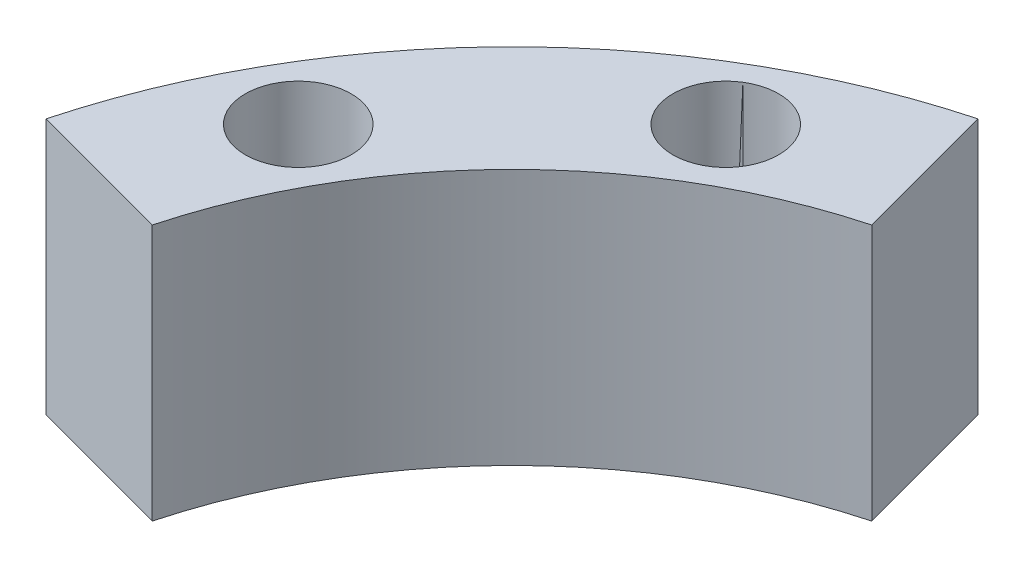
ISO-10303-21;
HEADER;
FILE_DESCRIPTION(('STEP AP214'),'2;1');
FILE_NAME('part.step','',(''),(''),'','','');
FILE_SCHEMA(('AUTOMOTIVE_DESIGN { 1 0 10303 214 1 1 1 1 }'));
ENDSEC;
DATA;
#1=APPLICATION_CONTEXT('core data for automotive mechanical design processes');
#2=APPLICATION_PROTOCOL_DEFINITION('international standard','automotive_design',2000,#1);
#3=PRODUCT_CONTEXT('',#1,'mechanical');
#4=PRODUCT('Part','Part','',(#3));
#5=PRODUCT_RELATED_PRODUCT_CATEGORY('part','',(#4));
#6=PRODUCT_DEFINITION_FORMATION('','',#4);
#7=PRODUCT_DEFINITION_CONTEXT('part definition',#1,'design');
#8=PRODUCT_DEFINITION('design','',#6,#7);
#9=PRODUCT_DEFINITION_SHAPE('','',#8);
#10=(LENGTH_UNIT() NAMED_UNIT(*) SI_UNIT(.MILLI.,.METRE.));
#11=(NAMED_UNIT(*) PLANE_ANGLE_UNIT() SI_UNIT($,.RADIAN.));
#12=(NAMED_UNIT(*) SI_UNIT($,.STERADIAN.) SOLID_ANGLE_UNIT());
#13=UNCERTAINTY_MEASURE_WITH_UNIT(LENGTH_MEASURE(1.E-05),#10,'distance_accuracy_value','');
#14=(GEOMETRIC_REPRESENTATION_CONTEXT(3) GLOBAL_UNCERTAINTY_ASSIGNED_CONTEXT((#13)) GLOBAL_UNIT_ASSIGNED_CONTEXT((#10,
#11,#12)) REPRESENTATION_CONTEXT('',''));
#15=CARTESIAN_POINT('',(0.,0.,0.));
#16=DIRECTION('',(0.,0.,1.));
#17=DIRECTION('',(1.,0.,0.));
#18=AXIS2_PLACEMENT_3D('',#15,#16,#17);
#19=CARTESIAN_POINT('',(-31.5547614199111,16.,-18.2181499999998));
#20=DIRECTION('',(0.,-1.,0.));
#21=DIRECTION('',(0.,0.,-1.));
#22=AXIS2_PLACEMENT_3D('',#19,#20,#21);
#23=CYLINDRICAL_SURFACE('',#22,3.302);
#24=CARTESIAN_POINT('',(-34.4227011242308,9.11084402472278,-19.8546480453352));
#25=CARTESIAN_POINT('',(-34.4074724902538,9.08833035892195,-19.8813385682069));
#26=CARTESIAN_POINT('',(-34.3923408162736,9.06454987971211,-19.906988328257));
#27=CARTESIAN_POINT('',(-34.3625198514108,9.01459789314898,-19.9561143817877));
#28=CARTESIAN_POINT('',(-34.3478304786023,8.98842683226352,-19.9795910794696));
#29=CARTESIAN_POINT('',(-34.3048659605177,8.90667310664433,-20.0465195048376));
#30=CARTESIAN_POINT('',(-34.2776110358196,8.84772897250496,-20.08661204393));
#31=CARTESIAN_POINT('',(-34.2277723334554,8.72264505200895,-20.1572469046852));
#32=CARTESIAN_POINT('',(-34.2051886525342,8.65650511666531,-20.1877890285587));
#33=CARTESIAN_POINT('',(-34.1661903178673,8.51885823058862,-20.2392109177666));
#34=CARTESIAN_POINT('',(-34.149776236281,8.44735078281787,-20.2600897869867));
#35=CARTESIAN_POINT('',(-34.1240301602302,8.29990981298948,-20.2923967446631));
#36=CARTESIAN_POINT('',(-34.114801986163,8.22392787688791,-20.3036864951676));
#37=CARTESIAN_POINT('',(-34.1044381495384,8.07058470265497,-20.3163445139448));
#38=CARTESIAN_POINT('',(-34.1033041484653,7.99322318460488,-20.3177107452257));
#39=CARTESIAN_POINT('',(-34.109243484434,7.83839950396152,-20.3104807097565));
#40=CARTESIAN_POINT('',(-34.1164101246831,7.76094616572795,-20.3017711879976));
#41=CARTESIAN_POINT('',(-34.13861272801,7.60903082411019,-20.2741719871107));
#42=CARTESIAN_POINT('',(-34.1536490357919,7.53456895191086,-20.2552818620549));
#43=CARTESIAN_POINT('',(-34.1905200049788,7.39088341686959,-20.2073434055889));
#44=CARTESIAN_POINT('',(-34.2123464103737,7.32165351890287,-20.1783074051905));
#45=CARTESIAN_POINT('',(-34.2612638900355,7.19040383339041,-20.1101844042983));
#46=CARTESIAN_POINT('',(-34.288350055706,7.12837740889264,-20.0711067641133));
#47=CARTESIAN_POINT('',(-34.3338507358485,7.03731292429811,-20.0016304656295));
#48=CARTESIAN_POINT('',(-34.3511888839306,7.00528084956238,-19.9743776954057));
#49=CARTESIAN_POINT('',(-34.386539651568,6.94461784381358,-19.9167908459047));
#50=CARTESIAN_POINT('',(-34.4045514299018,6.9159828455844,-19.88646053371));
#51=CARTESIAN_POINT('',(-34.4227011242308,6.88915597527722,-19.8546480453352));
#52=B_SPLINE_CURVE_WITH_KNOTS('',3,(#24,#25,#26,#27,#28,#29,#30,#31,#32,#33,#34,#35,#36,#37,#38,
#39,#40,#41,#42,#43,#44,#45,#46,#47,#48,#49,#50,#51),.UNSPECIFIED.,.F.,.F.,(4,2,2,2,2,2,2,2,2,2,
2,2,2,4),(0.,0.114209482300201,0.228397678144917,0.4561682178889,0.68394347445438,
0.911739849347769,1.14276927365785,1.37384611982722,1.60754579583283,1.84125570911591,
2.0746825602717,2.3078926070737,2.44414870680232,2.58023998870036),.UNSPECIFIED.);
#53=CARTESIAN_POINT('',(-34.4227011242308,9.11084402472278,-19.8546480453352));
#54=VERTEX_POINT('',#53);
#55=CARTESIAN_POINT('',(-34.4227011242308,6.88915597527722,-19.8546480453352));
#56=VERTEX_POINT('',#55);
#57=EDGE_CURVE('E278',#54,#56,#52,.T.);
#58=ORIENTED_EDGE('',*,*,#57,.T.);
#59=CARTESIAN_POINT('',(-34.3073632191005,7.09321680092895,-20.0419886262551));
#60=CARTESIAN_POINT('',(-34.2840107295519,7.142414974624,-20.077233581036));
#61=CARTESIAN_POINT('',(-34.2619321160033,7.19467734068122,-20.1090877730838));
#62=CARTESIAN_POINT('',(-34.2213586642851,7.30416473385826,-20.1658883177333));
#63=CARTESIAN_POINT('',(-34.2028680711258,7.36139552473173,-20.1908265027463));
#64=CARTESIAN_POINT('',(-34.1674073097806,7.49042518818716,-20.2376314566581));
#65=CARTESIAN_POINT('',(-34.1513273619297,7.56297896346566,-20.2581116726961));
#66=CARTESIAN_POINT('',(-34.1265332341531,7.7113733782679,-20.2892831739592));
#67=CARTESIAN_POINT('',(-34.117820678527,7.78721473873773,-20.2999723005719));
#68=CARTESIAN_POINT('',(-34.1082527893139,7.94190004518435,-20.3116990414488));
#69=CARTESIAN_POINT('',(-34.1075826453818,8.02077293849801,-20.312509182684));
#70=CARTESIAN_POINT('',(-34.1146316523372,8.17757759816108,-20.3038867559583));
#71=CARTESIAN_POINT('',(-34.1223510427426,8.25550933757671,-20.2944538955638));
#72=CARTESIAN_POINT('',(-34.1456382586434,8.40833744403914,-20.2653203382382));
#73=CARTESIAN_POINT('',(-34.1612173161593,8.48322930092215,-20.2456049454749));
#74=CARTESIAN_POINT('',(-34.1991270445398,8.6277273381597,-20.195902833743));
#75=CARTESIAN_POINT('',(-34.2214585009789,8.69733290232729,-20.165914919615));
#76=CARTESIAN_POINT('',(-34.2711852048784,8.82881154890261,-20.0959341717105));
#77=CARTESIAN_POINT('',(-34.298552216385,8.8907246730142,-20.0559967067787));
#78=CARTESIAN_POINT('',(-34.3565795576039,9.0052081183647,-19.9662533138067));
#79=CARTESIAN_POINT('',(-34.3872397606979,9.05777879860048,-19.9164477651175));
#80=CARTESIAN_POINT('',(-34.4481407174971,9.14898173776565,-19.8103508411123));
#81=CARTESIAN_POINT('',(-34.4783219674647,9.18819173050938,-19.7545246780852));
#82=CARTESIAN_POINT('',(-34.5378235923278,9.25420347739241,-19.6355227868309));
#83=CARTESIAN_POINT('',(-34.5671447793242,9.28101731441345,-19.5723542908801));
#84=CARTESIAN_POINT('',(-34.6195272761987,9.31774707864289,-19.4487380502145));
#85=CARTESIAN_POINT('',(-34.6429132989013,9.32935270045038,-19.3889326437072));
#86=CARTESIAN_POINT('',(-34.6864064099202,9.34022795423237,-19.2670391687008));
#87=CARTESIAN_POINT('',(-34.706517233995,9.33951174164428,-19.2049538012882));
#88=CARTESIAN_POINT('',(-34.740038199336,9.32601381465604,-19.0900866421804));
#89=CARTESIAN_POINT('',(-34.7539965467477,9.31498881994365,-19.0372556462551));
#90=CARTESIAN_POINT('',(-34.7787099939,9.28327192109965,-18.9338170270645));
#91=CARTESIAN_POINT('',(-34.7894684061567,9.26259007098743,-18.8832071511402));
#92=CARTESIAN_POINT('',(-34.807046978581,9.21437164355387,-18.7907369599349));
#93=CARTESIAN_POINT('',(-34.8141402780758,9.18765105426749,-18.7485006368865));
#94=CARTESIAN_POINT('',(-34.8261043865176,9.12730830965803,-18.6688643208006));
#95=CARTESIAN_POINT('',(-34.8309733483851,9.09368045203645,-18.6314683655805));
#96=CARTESIAN_POINT('',(-34.83883272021,9.02132798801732,-18.5634489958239));
#97=CARTESIAN_POINT('',(-34.8418602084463,8.98272437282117,-18.5327005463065));
#98=CARTESIAN_POINT('',(-34.8466502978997,8.90111837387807,-18.4778269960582));
#99=CARTESIAN_POINT('',(-34.8484157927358,8.85812631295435,-18.4536868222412));
#100=CARTESIAN_POINT('',(-34.8504622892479,8.79044147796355,-18.4222906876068));
#101=CARTESIAN_POINT('',(-34.8510488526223,8.76689481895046,-18.4124988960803));
#102=CARTESIAN_POINT('',(-34.8520467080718,8.71908859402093,-18.3947657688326));
#103=CARTESIAN_POINT('',(-34.8524578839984,8.69482856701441,-18.3868256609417));
#104=CARTESIAN_POINT('',(-34.8531472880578,8.6457084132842,-18.3727603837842));
#105=CARTESIAN_POINT('',(-34.8534250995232,8.6208466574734,-18.3666409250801));
#106=CARTESIAN_POINT('',(-34.853878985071,8.57079916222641,-18.3561876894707));
#107=CARTESIAN_POINT('',(-34.854055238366,8.54561407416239,-18.3518507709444));
#108=CARTESIAN_POINT('',(-34.8543882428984,8.48481946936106,-18.3434182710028));
#109=CARTESIAN_POINT('',(-34.8545085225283,8.44909840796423,-18.340124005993));
#110=CARTESIAN_POINT('',(-34.8546489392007,8.37750329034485,-18.3362569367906));
#111=CARTESIAN_POINT('',(-34.8546689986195,8.34162913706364,-18.335686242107));
#112=CARTESIAN_POINT('',(-34.8546442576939,8.26976935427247,-18.3363730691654));
#113=CARTESIAN_POINT('',(-34.8545991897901,8.23378387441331,-18.337638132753));
#114=CARTESIAN_POINT('',(-34.8544891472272,8.16185493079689,-18.340635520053));
#115=CARTESIAN_POINT('',(-34.8544241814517,8.12591145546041,-18.3423676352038));
#116=CARTESIAN_POINT('',(-34.8543354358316,8.05364471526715,-18.3447110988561));
#117=CARTESIAN_POINT('',(-34.8543120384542,8.01732098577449,-18.3453120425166));
#118=CARTESIAN_POINT('',(-34.854333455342,7.94467501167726,-18.3447520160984));
#119=CARTESIAN_POINT('',(-34.8543783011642,7.90835277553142,-18.3435902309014));
#120=CARTESIAN_POINT('',(-34.8544882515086,7.83581346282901,-18.3406584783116));
#121=CARTESIAN_POINT('',(-34.8545533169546,7.79959631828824,-18.3388896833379));
#122=CARTESIAN_POINT('',(-34.8546442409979,7.72713325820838,-18.3363864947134));
#123=CARTESIAN_POINT('',(-34.8546701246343,7.69088737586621,-18.3356514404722));
#124=CARTESIAN_POINT('',(-34.8546452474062,7.62610589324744,-18.3363485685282));
#125=CARTESIAN_POINT('',(-34.8546096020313,7.59756827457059,-18.3373534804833));
#126=CARTESIAN_POINT('',(-34.8544702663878,7.54060995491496,-18.3411510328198));
#127=CARTESIAN_POINT('',(-34.8543665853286,7.51218923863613,-18.343943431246));
#128=CARTESIAN_POINT('',(-34.854067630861,7.45582684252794,-18.3515565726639));
#129=CARTESIAN_POINT('',(-34.8538730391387,7.42788317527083,-18.3563621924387));
#130=CARTESIAN_POINT('',(-34.8533574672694,7.37245941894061,-18.3681557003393));
#131=CARTESIAN_POINT('',(-34.8530364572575,7.3449794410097,-18.3751441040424));
#132=CARTESIAN_POINT('',(-34.8518085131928,7.2629788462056,-18.3997134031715));
#133=CARTESIAN_POINT('',(-34.8506378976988,7.20945947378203,-18.4208288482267));
#134=CARTESIAN_POINT('',(-34.847047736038,7.10689738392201,-18.4725564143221));
#135=CARTESIAN_POINT('',(-34.8446216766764,7.05787959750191,-18.5032177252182));
#136=CARTESIAN_POINT('',(-34.8380630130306,6.97000843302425,-18.570551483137));
#137=CARTESIAN_POINT('',(-34.8340715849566,6.93066907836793,-18.6066029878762));
#138=CARTESIAN_POINT('',(-34.8238505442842,6.8592127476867,-18.684847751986));
#139=CARTESIAN_POINT('',(-34.8176266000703,6.82707781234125,-18.7270252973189));
#140=CARTESIAN_POINT('',(-34.8030056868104,6.77284054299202,-18.8130315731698));
#141=CARTESIAN_POINT('',(-34.7947836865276,6.75020755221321,-18.8565568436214));
#142=CARTESIAN_POINT('',(-34.7758080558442,6.71249770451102,-18.9462733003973));
#143=CARTESIAN_POINT('',(-34.7650530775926,6.69742488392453,-18.9924658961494));
#144=CARTESIAN_POINT('',(-34.7410423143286,6.67502972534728,-19.0859898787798));
#145=CARTESIAN_POINT('',(-34.727789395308,6.66769856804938,-19.1333199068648));
#146=CARTESIAN_POINT('',(-34.6989933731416,6.66060116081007,-19.2278289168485));
#147=CARTESIAN_POINT('',(-34.6834502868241,6.66083485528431,-19.2750078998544));
#148=CARTESIAN_POINT('',(-34.6495011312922,6.66870017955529,-19.3707627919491));
#149=CARTESIAN_POINT('',(-34.6309818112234,6.67675654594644,-19.419262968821));
#150=CARTESIAN_POINT('',(-34.5923829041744,6.70026231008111,-19.5137856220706));
#151=CARTESIAN_POINT('',(-34.5723024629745,6.71571577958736,-19.5598067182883));
#152=CARTESIAN_POINT('',(-34.5290287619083,6.75532701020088,-19.6533756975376));
#153=CARTESIAN_POINT('',(-34.5057331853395,6.78024304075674,-19.7005540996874));
#154=CARTESIAN_POINT('',(-34.4589698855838,6.83727412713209,-19.7901984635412));
#155=CARTESIAN_POINT('',(-34.4355021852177,6.86938824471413,-19.8326650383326));
#156=CARTESIAN_POINT('',(-34.3941583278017,6.93245085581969,-19.9040793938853));
#157=CARTESIAN_POINT('',(-34.3761427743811,6.96222818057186,-19.9339934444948));
#158=CARTESIAN_POINT('',(-34.3409940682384,7.02523325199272,-19.9904982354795));
#159=CARTESIAN_POINT('',(-34.3238607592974,7.05846038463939,-20.0170895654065));
#160=CARTESIAN_POINT('',(-34.3073632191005,7.09321680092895,-20.0419886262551));
#161=B_SPLINE_CURVE_WITH_KNOTS('',3,(#59,#60,#61,#62,#63,#64,#65,#66,#67,#68,#69,#70,#71,#72,
#73,#74,#75,#76,#77,#78,#79,#80,#81,#82,#83,#84,#85,#86,#87,#88,#89,#90,#91,#92,#93,#94,#95,#96,
#97,#98,#99,#100,#101,#102,#103,#104,#105,#106,#107,#108,#109,#110,#111,#112,#113,#114,#115,
#116,#117,#118,#119,#120,#121,#122,#123,#124,#125,#126,#127,#128,#129,#130,#131,#132,#133,#134,
#135,#136,#137,#138,#139,#140,#141,#142,#143,#144,#145,#146,#147,#148,#149,#150,#151,#152,#153,
#154,#155,#156,#157,#158,#159,#160),.UNSPECIFIED.,.T.,.F.,(4,2,2,2,2,2,2,2,2,2,2,2,2,2,2,2,2,2,
2,2,2,2,2,2,2,2,2,2,2,2,2,2,2,2,2,2,2,2,2,2,2,2,2,2,2,2,2,2,2,2,4),(0.,0.194483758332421,
0.389196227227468,0.619370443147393,0.849595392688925,1.08511174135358,1.3206348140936,
1.55649542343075,1.79238348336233,2.02698706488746,2.26158162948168,2.48411284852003,
2.70642670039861,2.90102927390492,3.09540830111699,3.26172648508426,3.42787189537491,
3.57857166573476,3.72939635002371,3.87707389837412,4.02441174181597,4.10087122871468,
4.17738127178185,4.25412882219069,4.33074052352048,4.4382206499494,4.54578401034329,
4.6537905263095,4.76174889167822,4.87069552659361,4.97969255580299,5.08848023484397,
5.19719836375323,5.28281829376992,5.36842663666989,5.45340310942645,5.53839966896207,
5.71007082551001,5.88264166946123,6.04230815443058,6.20157208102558,6.35008930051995,
6.49868572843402,6.64711269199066,6.79553856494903,6.95250150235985,7.1095509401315,
7.28351654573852,7.4574594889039,7.59487840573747,7.73227290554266),.UNSPECIFIED.);
#162=EDGE_CURVE('E283',#56,#54,#161,.T.);
#163=ORIENTED_EDGE('',*,*,#162,.T.);
#164=EDGE_LOOP('',(#58,#163));
#165=FACE_BOUND('',#164,.T.);
#166=CARTESIAN_POINT('',(-31.5547614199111,16.,-18.2181499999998));
#167=DIRECTION('',(0.,1.,0.));
#168=DIRECTION('',(0.,0.,1.));
#169=AXIS2_PLACEMENT_3D('',#166,#167,#168);
#170=CIRCLE('',#169,3.302);
#171=CARTESIAN_POINT('',(-31.5547614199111,16.,-14.9161499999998));
#172=VERTEX_POINT('',#171);
#173=EDGE_CURVE('E315',#172,#172,#170,.T.);
#174=ORIENTED_EDGE('',*,*,#173,.T.);
#175=EDGE_LOOP('',(#174));
#176=FACE_BOUND('',#175,.T.);
#177=CARTESIAN_POINT('',(-31.5547614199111,0.,-18.2181499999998));
#178=DIRECTION('',(0.,1.,0.));
#179=DIRECTION('',(0.,0.,1.));
#180=AXIS2_PLACEMENT_3D('',#177,#178,#179);
#181=CIRCLE('',#180,3.302);
#182=CARTESIAN_POINT('',(-31.5547614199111,0.,-14.9161499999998));
#183=VERTEX_POINT('',#182);
#184=EDGE_CURVE('E323',#183,#183,#181,.T.);
#185=ORIENTED_EDGE('',*,*,#184,.F.);
#186=EDGE_LOOP('',(#185));
#187=FACE_BOUND('',#186,.T.);
#188=DIRECTION('',(0.,-1.,0.));
#189=VECTOR('',#188,1.);
#190=CARTESIAN_POINT('',(-34.8539265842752,16.,-18.0813537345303));
#191=LINE('',#190,#189);
#192=CARTESIAN_POINT('',(-34.8539265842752,7.5871945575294,-18.0813537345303));
#193=VERTEX_POINT('',#192);
#194=CARTESIAN_POINT('',(-34.8539265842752,8.4128054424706,-18.0813537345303));
#195=VERTEX_POINT('',#194);
#196=EDGE_CURVE('E178',#193,#195,#191,.F.);
#197=ORIENTED_EDGE('',*,*,#196,.T.);
#198=CARTESIAN_POINT('',(-31.5547614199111,9.8155308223,-18.2181499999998));
#199=DIRECTION('',(0.353553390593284,-0.86602540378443,-0.353553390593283));
#200=DIRECTION('',(-0.612372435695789,-0.500000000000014,0.612372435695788));
#201=AXIS2_PLACEMENT_3D('',#198,#199,#200);
#202=ELLIPSE('',#201,3.81282117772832,3.302);
#203=CARTESIAN_POINT('',(-34.7625779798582,8.8256108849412,-19.0011678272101));
#204=VERTEX_POINT('',#203);
#205=EDGE_CURVE('E172',#195,#204,#202,.T.);
#206=ORIENTED_EDGE('',*,*,#205,.T.);
#207=CARTESIAN_POINT('',(-31.5547614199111,7.8356909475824,-18.2181499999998));
#208=DIRECTION('',(-0.353553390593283,-0.866025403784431,0.353553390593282));
#209=DIRECTION('',(0.61237243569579,-0.500000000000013,-0.612372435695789));
#210=AXIS2_PLACEMENT_3D('',#207,#208,#209);
#211=ELLIPSE('',#210,3.81282117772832,3.302);
#212=CARTESIAN_POINT('',(-34.4868907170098,8.4128054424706,-19.7366432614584));
#213=VERTEX_POINT('',#212);
#214=EDGE_CURVE('E161',#204,#213,#211,.T.);
#215=ORIENTED_EDGE('',*,*,#214,.T.);
#216=DIRECTION('',(0.,-1.,0.));
#217=VECTOR('',#216,1.);
#218=CARTESIAN_POINT('',(-34.4868907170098,16.,-19.7366432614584));
#219=LINE('',#218,#217);
#220=CARTESIAN_POINT('',(-34.4868907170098,7.5871945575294,-19.7366432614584));
#221=VERTEX_POINT('',#220);
#222=EDGE_CURVE('E166',#213,#221,#219,.T.);
#223=ORIENTED_EDGE('',*,*,#222,.T.);
#224=CARTESIAN_POINT('',(-31.5547614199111,8.16430905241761,-18.2181499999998));
#225=DIRECTION('',(-0.353553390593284,0.866025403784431,0.353553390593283));
#226=DIRECTION('',(-0.61237243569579,-0.500000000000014,0.612372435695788));
#227=AXIS2_PLACEMENT_3D('',#224,#225,#226);
#228=ELLIPSE('',#227,3.81282117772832,3.302);
#229=CARTESIAN_POINT('',(-34.7625779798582,7.1743891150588,-19.0011678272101));
#230=VERTEX_POINT('',#229);
#231=EDGE_CURVE('E665',#221,#230,#228,.T.);
#232=ORIENTED_EDGE('',*,*,#231,.T.);
#233=CARTESIAN_POINT('',(-31.5547614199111,6.18446917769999,-18.2181499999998));
#234=DIRECTION('',(0.353553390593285,0.86602540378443,-0.353553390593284));
#235=DIRECTION('',(0.612372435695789,-0.500000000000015,-0.612372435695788));
#236=AXIS2_PLACEMENT_3D('',#233,#234,#235);
#237=ELLIPSE('',#236,3.81282117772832,3.302);
#238=EDGE_CURVE('E183',#230,#193,#237,.T.);
#239=ORIENTED_EDGE('',*,*,#238,.T.);
#240=EDGE_LOOP('',(#197,#206,#215,#223,#232,#239));
#241=FACE_BOUND('',#240,.T.);
#242=ADVANCED_FACE('F33',(#165,#176,#187,#241),#23,.F.);
#243=CARTESIAN_POINT('',(-35.0193796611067,8.,-19.2579695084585));
#244=DIRECTION('',(0.707106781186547,0.,0.707106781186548));
#245=DIRECTION('',(0.707106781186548,0.,-0.707106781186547));
#246=AXIS2_PLACEMENT_3D('',#243,#244,#245);
#247=DEGENERATE_TOROIDAL_SURFACE('',#246,0.626548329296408,0.768451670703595,.T.);
#248=CARTESIAN_POINT('',(-35.0193796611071,8.,-19.2579695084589));
#249=DIRECTION('',(0.707106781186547,0.,0.707106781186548));
#250=DIRECTION('',(0.707106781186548,0.,-0.707106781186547));
#251=AXIS2_PLACEMENT_3D('',#248,#249,#250);
#252=CIRCLE('',#251,1.395);
#253=EDGE_CURVE('E228',#54,#56,#252,.T.);
#254=ORIENTED_EDGE('',*,*,#253,.F.);
#255=ORIENTED_EDGE('',*,*,#162,.F.);
#256=EDGE_LOOP('',(#254,#255));
#257=FACE_BOUND('',#256,.T.);
#258=CARTESIAN_POINT('',(-35.0383449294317,8.4126054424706,-20.2885873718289));
#259=CARTESIAN_POINT('',(-35.0625868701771,8.42974610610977,-20.2708434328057));
#260=CARTESIAN_POINT('',(-35.0861664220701,8.44694226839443,-20.2523011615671));
#261=CARTESIAN_POINT('',(-35.1322822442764,8.48138194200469,-20.2140573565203));
#262=CARTESIAN_POINT('',(-35.1548195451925,8.49862538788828,-20.1943570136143));
#263=CARTESIAN_POINT('',(-35.1991223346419,8.53308585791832,-20.1542492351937));
#264=CARTESIAN_POINT('',(-35.2208896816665,8.55030283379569,-20.1338437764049));
#265=CARTESIAN_POINT('',(-35.2639551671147,8.58474925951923,-20.0925330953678));
#266=CARTESIAN_POINT('',(-35.2852531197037,8.60197871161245,-20.0716276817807));
#267=CARTESIAN_POINT('',(-35.3274564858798,8.63643761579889,-20.0294243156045));
#268=CARTESIAN_POINT('',(-35.348361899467,8.65366706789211,-20.0081263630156));
#269=CARTESIAN_POINT('',(-35.3896725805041,8.68811349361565,-19.9650608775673));
#270=CARTESIAN_POINT('',(-35.4100780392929,8.70533046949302,-19.9432935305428));
#271=CARTESIAN_POINT('',(-35.4501858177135,8.73979093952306,-19.8989907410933));
#272=CARTESIAN_POINT('',(-35.4698861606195,8.75703438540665,-19.8764534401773));
#273=CARTESIAN_POINT('',(-35.5081299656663,8.7914740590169,-19.830337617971));
#274=CARTESIAN_POINT('',(-35.5266722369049,8.80867022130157,-19.806758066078));
#275=CARTESIAN_POINT('',(-35.5444161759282,8.82581088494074,-19.7825161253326));
#276=B_SPLINE_CURVE_WITH_KNOTS('',3,(#258,#259,#260,#261,#262,#263,#264,#265,#266,#267,#268,
#269,#270,#271,#272,#273,#274,#275),.UNSPECIFIED.,.F.,.F.,(4,2,2,2,2,2,2,2,4),(0.,
0.103709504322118,0.207314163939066,0.310648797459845,0.414023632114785,0.517398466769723,
0.620733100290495,0.724337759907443,0.828047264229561),.UNSPECIFIED.);
#277=CARTESIAN_POINT('',(-35.0386278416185,8.4128054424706,-20.2883803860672));
#278=VERTEX_POINT('',#277);
#279=CARTESIAN_POINT('',(-35.5442091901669,8.8256108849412,-19.7827990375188));
#280=VERTEX_POINT('',#279);
#281=EDGE_CURVE('E345',#278,#280,#276,.T.);
#282=ORIENTED_EDGE('',*,*,#281,.T.);
#283=CARTESIAN_POINT('',(-35.5439262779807,8.82581088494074,-19.7830060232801));
#284=CARTESIAN_POINT('',(-35.5681682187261,8.80867022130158,-19.7652620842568));
#285=CARTESIAN_POINT('',(-35.5917477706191,8.79147405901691,-19.7467198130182));
#286=CARTESIAN_POINT('',(-35.6378635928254,8.75703438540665,-19.7084760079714));
#287=CARTESIAN_POINT('',(-35.6604008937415,8.73979093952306,-19.6887756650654));
#288=CARTESIAN_POINT('',(-35.7047036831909,8.70533046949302,-19.6486678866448));
#289=CARTESIAN_POINT('',(-35.7264710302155,8.68811349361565,-19.628262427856));
#290=CARTESIAN_POINT('',(-35.7695365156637,8.65366706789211,-19.5869517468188));
#291=CARTESIAN_POINT('',(-35.7908344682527,8.63643761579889,-19.5660463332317));
#292=CARTESIAN_POINT('',(-35.8330378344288,8.60197871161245,-19.5238429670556));
#293=CARTESIAN_POINT('',(-35.8539432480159,8.58474925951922,-19.5025450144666));
#294=CARTESIAN_POINT('',(-35.895253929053,8.55030283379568,-19.4594795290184));
#295=CARTESIAN_POINT('',(-35.9156593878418,8.53308585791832,-19.4377121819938));
#296=CARTESIAN_POINT('',(-35.9557671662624,8.49862538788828,-19.3934093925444));
#297=CARTESIAN_POINT('',(-35.9754675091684,8.48138194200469,-19.3708720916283));
#298=CARTESIAN_POINT('',(-36.0137113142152,8.44694226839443,-19.3247562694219));
#299=CARTESIAN_POINT('',(-36.0322535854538,8.42974610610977,-19.301176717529));
#300=CARTESIAN_POINT('',(-36.049997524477,8.4126054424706,-19.2769347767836));
#301=B_SPLINE_CURVE_WITH_KNOTS('',3,(#283,#284,#285,#286,#287,#288,#289,#290,#291,#292,#293,
#294,#295,#296,#297,#298,#299,#300),.UNSPECIFIED.,.F.,.F.,(4,2,2,2,2,2,2,2,4),(0.,
0.103709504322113,0.207314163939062,0.310648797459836,0.41402363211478,0.51739846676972,
0.620733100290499,0.724337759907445,0.828047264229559),.UNSPECIFIED.);
#302=CARTESIAN_POINT('',(-36.049790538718,8.4128054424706,-19.2772176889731));
#303=VERTEX_POINT('',#302);
#304=EDGE_CURVE('E11',#280,#303,#301,.T.);
#305=ORIENTED_EDGE('',*,*,#304,.T.);
#306=CARTESIAN_POINT('',(-36.0497715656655,8.4130054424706,-19.2771987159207));
#307=CARTESIAN_POINT('',(-36.053016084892,8.37874043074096,-19.2804432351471));
#308=CARTESIAN_POINT('',(-36.0555313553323,8.34436468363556,-19.2829585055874));
#309=CARTESIAN_POINT('',(-36.0594622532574,8.27551869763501,-19.2868894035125));
#310=CARTESIAN_POINT('',(-36.0608789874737,8.24104858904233,-19.2883061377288));
#311=CARTESIAN_POINT('',(-36.0629740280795,8.17216110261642,-19.2904011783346));
#312=CARTESIAN_POINT('',(-36.0636542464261,8.13774382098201,-19.2910813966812));
#313=CARTESIAN_POINT('',(-36.0645307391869,8.06888436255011,-19.291957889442));
#314=CARTESIAN_POINT('',(-36.0647268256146,8.03444218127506,-19.2921539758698));
#315=CARTESIAN_POINT('',(-36.0647268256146,7.96555781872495,-19.2921539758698));
#316=CARTESIAN_POINT('',(-36.0645307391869,7.93111563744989,-19.291957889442));
#317=CARTESIAN_POINT('',(-36.0636542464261,7.862256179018,-19.2910813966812));
#318=CARTESIAN_POINT('',(-36.0629740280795,7.82783889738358,-19.2904011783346));
#319=CARTESIAN_POINT('',(-36.0608789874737,7.75895141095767,-19.2883061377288));
#320=CARTESIAN_POINT('',(-36.0594622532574,7.72448130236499,-19.2868894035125));
#321=CARTESIAN_POINT('',(-36.0555313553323,7.65563531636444,-19.2829585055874));
#322=CARTESIAN_POINT('',(-36.053016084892,7.62125956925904,-19.2804432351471));
#323=CARTESIAN_POINT('',(-36.0497715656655,7.5869945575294,-19.2771987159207));
#324=B_SPLINE_CURVE_WITH_KNOTS('',3,(#306,#307,#308,#309,#310,#311,#312,#313,#314,#315,#316,
#317,#318,#319,#320,#321,#322,#323),.UNSPECIFIED.,.F.,.F.,(4,2,2,2,2,2,2,2,4),(0.,
0.103658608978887,0.207212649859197,0.310497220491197,0.413821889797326,0.517146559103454,
0.620431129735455,0.723985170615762,0.827643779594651),.UNSPECIFIED.);
#325=CARTESIAN_POINT('',(-36.049790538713,7.5871945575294,-19.2772176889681));
#326=VERTEX_POINT('',#325);
#327=EDGE_CURVE('E47',#303,#326,#324,.T.);
#328=ORIENTED_EDGE('',*,*,#327,.T.);
#329=CARTESIAN_POINT('',(-36.049997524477,7.5873945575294,-19.2769347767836));
#330=CARTESIAN_POINT('',(-36.0322535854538,7.57025389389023,-19.301176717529));
#331=CARTESIAN_POINT('',(-36.0137113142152,7.55305773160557,-19.3247562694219));
#332=CARTESIAN_POINT('',(-35.9754675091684,7.51861805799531,-19.3708720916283));
#333=CARTESIAN_POINT('',(-35.9557671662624,7.50137461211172,-19.3934093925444));
#334=CARTESIAN_POINT('',(-35.9156593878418,7.46691414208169,-19.4377121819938));
#335=CARTESIAN_POINT('',(-35.895253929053,7.44969716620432,-19.4594795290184));
#336=CARTESIAN_POINT('',(-35.8539432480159,7.41525074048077,-19.5025450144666));
#337=CARTESIAN_POINT('',(-35.8330378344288,7.39802128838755,-19.5238429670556));
#338=CARTESIAN_POINT('',(-35.7908344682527,7.36356238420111,-19.5660463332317));
#339=CARTESIAN_POINT('',(-35.7695365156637,7.34633293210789,-19.5869517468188));
#340=CARTESIAN_POINT('',(-35.7264710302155,7.31188650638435,-19.628262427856));
#341=CARTESIAN_POINT('',(-35.7047036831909,7.29466953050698,-19.6486678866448));
#342=CARTESIAN_POINT('',(-35.6604008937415,7.26020906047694,-19.6887756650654));
#343=CARTESIAN_POINT('',(-35.6378635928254,7.24296561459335,-19.7084760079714));
#344=CARTESIAN_POINT('',(-35.5917477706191,7.20852594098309,-19.7467198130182));
#345=CARTESIAN_POINT('',(-35.5681682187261,7.19132977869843,-19.7652620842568));
#346=CARTESIAN_POINT('',(-35.5439262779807,7.17418911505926,-19.7830060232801));
#347=B_SPLINE_CURVE_WITH_KNOTS('',3,(#329,#330,#331,#332,#333,#334,#335,#336,#337,#338,#339,
#340,#341,#342,#343,#344,#345,#346),.UNSPECIFIED.,.F.,.F.,(4,2,2,2,2,2,2,2,4),(0.,
0.103709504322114,0.20731416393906,0.310648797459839,0.414023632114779,0.517398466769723,
0.620733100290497,0.724337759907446,0.828047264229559),.UNSPECIFIED.);
#348=CARTESIAN_POINT('',(-35.5442091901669,7.1743891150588,-19.7827990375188));
#349=VERTEX_POINT('',#348);
#350=EDGE_CURVE('E388',#326,#349,#347,.T.);
#351=ORIENTED_EDGE('',*,*,#350,.T.);
#352=CARTESIAN_POINT('',(-35.5444161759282,7.17418911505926,-19.7825161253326));
#353=CARTESIAN_POINT('',(-35.5266722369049,7.19132977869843,-19.806758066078));
#354=CARTESIAN_POINT('',(-35.5081299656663,7.20852594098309,-19.830337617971));
#355=CARTESIAN_POINT('',(-35.4698861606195,7.24296561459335,-19.8764534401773));
#356=CARTESIAN_POINT('',(-35.4501858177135,7.26020906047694,-19.8989907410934));
#357=CARTESIAN_POINT('',(-35.4100780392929,7.29466953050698,-19.9432935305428));
#358=CARTESIAN_POINT('',(-35.3896725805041,7.31188650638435,-19.9650608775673));
#359=CARTESIAN_POINT('',(-35.348361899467,7.34633293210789,-20.0081263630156));
#360=CARTESIAN_POINT('',(-35.3274564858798,7.36356238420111,-20.0294243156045));
#361=CARTESIAN_POINT('',(-35.2852531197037,7.39802128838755,-20.0716276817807));
#362=CARTESIAN_POINT('',(-35.2639551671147,7.41525074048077,-20.0925330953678));
#363=CARTESIAN_POINT('',(-35.2208896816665,7.44969716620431,-20.1338437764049));
#364=CARTESIAN_POINT('',(-35.1991223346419,7.46691414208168,-20.1542492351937));
#365=CARTESIAN_POINT('',(-35.1548195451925,7.50137461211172,-20.1943570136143));
#366=CARTESIAN_POINT('',(-35.1322822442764,7.51861805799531,-20.2140573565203));
#367=CARTESIAN_POINT('',(-35.0861664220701,7.55305773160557,-20.2523011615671));
#368=CARTESIAN_POINT('',(-35.0625868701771,7.57025389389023,-20.2708434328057));
#369=CARTESIAN_POINT('',(-35.0383449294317,7.5873945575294,-20.2885873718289));
#370=B_SPLINE_CURVE_WITH_KNOTS('',3,(#352,#353,#354,#355,#356,#357,#358,#359,#360,#361,#362,
#363,#364,#365,#366,#367,#368,#369),.UNSPECIFIED.,.F.,.F.,(4,2,2,2,2,2,2,2,4),(0.,
0.103709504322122,0.207314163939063,0.310648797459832,0.414023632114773,0.517398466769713,
0.620733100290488,0.724337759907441,0.82804726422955),.UNSPECIFIED.);
#371=CARTESIAN_POINT('',(-35.0386278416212,7.5871945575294,-20.2883803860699));
#372=VERTEX_POINT('',#371);
#373=EDGE_CURVE('E351',#349,#372,#370,.T.);
#374=ORIENTED_EDGE('',*,*,#373,.T.);
#375=CARTESIAN_POINT('',(-35.0386088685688,7.5869945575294,-20.2883614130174));
#376=CARTESIAN_POINT('',(-35.0418533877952,7.62125956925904,-20.2916059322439));
#377=CARTESIAN_POINT('',(-35.0443686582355,7.65563531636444,-20.2941212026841));
#378=CARTESIAN_POINT('',(-35.0482995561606,7.72448130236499,-20.2980521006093));
#379=CARTESIAN_POINT('',(-35.0497162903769,7.75895141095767,-20.2994688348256));
#380=CARTESIAN_POINT('',(-35.0518113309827,7.82783889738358,-20.3015638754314));
#381=CARTESIAN_POINT('',(-35.0524915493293,7.862256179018,-20.302244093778));
#382=CARTESIAN_POINT('',(-35.0533680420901,7.93111563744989,-20.3031205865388));
#383=CARTESIAN_POINT('',(-35.0535641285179,7.96555781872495,-20.3033166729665));
#384=CARTESIAN_POINT('',(-35.0535641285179,8.03444218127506,-20.3033166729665));
#385=CARTESIAN_POINT('',(-35.0533680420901,8.06888436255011,-20.3031205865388));
#386=CARTESIAN_POINT('',(-35.0524915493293,8.13774382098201,-20.302244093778));
#387=CARTESIAN_POINT('',(-35.0518113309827,8.17216110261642,-20.3015638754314));
#388=CARTESIAN_POINT('',(-35.0497162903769,8.24104858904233,-20.2994688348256));
#389=CARTESIAN_POINT('',(-35.0482995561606,8.27551869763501,-20.2980521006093));
#390=CARTESIAN_POINT('',(-35.0443686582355,8.34436468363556,-20.2941212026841));
#391=CARTESIAN_POINT('',(-35.0418533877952,8.37874043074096,-20.2916059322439));
#392=CARTESIAN_POINT('',(-35.0386088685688,8.4130054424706,-20.2883614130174));
#393=B_SPLINE_CURVE_WITH_KNOTS('',3,(#375,#376,#377,#378,#379,#380,#381,#382,#383,#384,#385,
#386,#387,#388,#389,#390,#391,#392),.UNSPECIFIED.,.F.,.F.,(4,2,2,2,2,2,2,2,4),(0.,
0.10365860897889,0.207212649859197,0.310497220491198,0.413821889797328,0.517146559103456,
0.620431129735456,0.723985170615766,0.827643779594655),.UNSPECIFIED.);
#394=EDGE_CURVE('E348',#372,#278,#393,.T.);
#395=ORIENTED_EDGE('',*,*,#394,.T.);
#396=EDGE_LOOP('',(#282,#305,#328,#351,#374,#395));
#397=FACE_BOUND('',#396,.T.);
#398=ADVANCED_FACE('F266',(#257,#397),#247,.T.);
#399=CARTESIAN_POINT('',(-18.2181500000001,16.,-31.5547614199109));
#400=DIRECTION('',(0.,-1.,0.));
#401=DIRECTION('',(0.,0.,-1.));
#402=AXIS2_PLACEMENT_3D('',#399,#400,#401);
#403=CYLINDRICAL_SURFACE('',#402,3.302);
#404=CARTESIAN_POINT('',(-20.0419886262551,7.09321680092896,-34.3073632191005));
#405=CARTESIAN_POINT('',(-20.0066828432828,7.04393731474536,-34.3307558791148));
#406=CARTESIAN_POINT('',(-19.967948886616,6.99769595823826,-34.355443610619));
#407=CARTESIAN_POINT('',(-19.8838507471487,6.91249496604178,-34.4062627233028));
#408=CARTESIAN_POINT('',(-19.838479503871,6.87354318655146,-34.4323956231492));
#409=CARTESIAN_POINT('',(-19.7365116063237,6.80063535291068,-34.4875889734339));
#410=CARTESIAN_POINT('',(-19.6792371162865,6.76762857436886,-34.5166696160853));
#411=CARTESIAN_POINT('',(-19.5583987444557,6.71405877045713,-34.5732657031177));
#412=CARTESIAN_POINT('',(-19.4948396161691,6.69348642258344,-34.600782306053));
#413=CARTESIAN_POINT('',(-19.3718234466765,6.66830700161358,-34.6492803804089));
#414=CARTESIAN_POINT('',(-19.312867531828,6.66200687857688,-34.6706481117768));
#415=CARTESIAN_POINT('',(-19.1937592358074,6.66128955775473,-34.7099641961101));
#416=CARTESIAN_POINT('',(-19.1336084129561,6.66685777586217,-34.7279167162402));
#417=CARTESIAN_POINT('',(-19.0228772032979,6.68872539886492,-34.7576429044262));
#418=CARTESIAN_POINT('',(-18.9721184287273,6.70344342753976,-34.7699268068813));
#419=CARTESIAN_POINT('',(-18.8734729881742,6.74193705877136,-34.7914727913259));
#420=CARTESIAN_POINT('',(-18.8255850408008,6.76570858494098,-34.8007362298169));
#421=CARTESIAN_POINT('',(-18.7380724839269,6.8195172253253,-34.8158514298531));
#422=CARTESIAN_POINT('',(-18.6980949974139,6.84892484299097,-34.8219121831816));
#423=CARTESIAN_POINT('',(-18.6234409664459,6.91409252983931,-34.8320108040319));
#424=CARTESIAN_POINT('',(-18.5887621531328,6.94984986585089,-34.8360495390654));
#425=CARTESIAN_POINT('',(-18.5259652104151,7.02630991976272,-34.8425335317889));
#426=CARTESIAN_POINT('',(-18.4977928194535,7.06696708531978,-34.844992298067));
#427=CARTESIAN_POINT('',(-18.4482235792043,7.15229371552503,-34.8488304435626));
#428=CARTESIAN_POINT('',(-18.4268325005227,7.19696655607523,-34.8502089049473));
#429=CARTESIAN_POINT('',(-18.3901683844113,7.29135250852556,-34.8523317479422));
#430=CARTESIAN_POINT('',(-18.3752578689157,7.34120616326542,-34.8530406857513));
#431=CARTESIAN_POINT('',(-18.3528866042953,7.44242274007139,-34.8540303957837));
#432=CARTESIAN_POINT('',(-18.3454124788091,7.4937827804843,-34.8543119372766));
#433=CARTESIAN_POINT('',(-18.3385117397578,7.57527027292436,-34.8545674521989));
#434=CARTESIAN_POINT('',(-18.3370235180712,7.6052544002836,-34.8546209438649));
#435=CARTESIAN_POINT('',(-18.3356962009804,7.66526232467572,-34.8546686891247));
#436=CARTESIAN_POINT('',(-18.3358574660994,7.69528612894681,-34.8546629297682));
#437=CARTESIAN_POINT('',(-18.3372140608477,7.75535768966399,-34.854614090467));
#438=CARTESIAN_POINT('',(-18.3384113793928,7.7854053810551,-34.85457093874));
#439=CARTESIAN_POINT('',(-18.3409867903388,7.8454730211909,-34.8544760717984));
#440=CARTESIAN_POINT('',(-18.3423647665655,7.87549297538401,-34.8544243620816));
#441=CARTESIAN_POINT('',(-18.3441751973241,7.92889942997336,-34.8543557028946));
#442=CARTESIAN_POINT('',(-18.3447495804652,7.95228035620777,-34.854333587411));
#443=CARTESIAN_POINT('',(-18.3452194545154,7.99904846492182,-34.8543155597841));
#444=CARTESIAN_POINT('',(-18.3451150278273,8.02243564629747,-34.8543196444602));
#445=CARTESIAN_POINT('',(-18.3438057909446,8.09263590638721,-34.8543696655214));
#446=CARTESIAN_POINT('',(-18.3416025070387,8.13942157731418,-34.854453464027));
#447=CARTESIAN_POINT('',(-18.3376594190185,8.23287377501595,-34.8545985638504));
#448=CARTESIAN_POINT('',(-18.3359182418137,8.27954023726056,-34.8546599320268));
#449=CARTESIAN_POINT('',(-18.3359509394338,8.37284412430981,-34.8546601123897));
#450=CARTESIAN_POINT('',(-18.337717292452,8.41948139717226,-34.854599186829));
#451=CARTESIAN_POINT('',(-18.3446512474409,8.49383177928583,-34.8543381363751));
#452=CARTESIAN_POINT('',(-18.3481871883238,8.52169610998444,-34.8542029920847));
#453=CARTESIAN_POINT('',(-18.3573197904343,8.5771110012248,-34.8538305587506));
#454=CARTESIAN_POINT('',(-18.362917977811,8.60466131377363,-34.8535931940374));
#455=CARTESIAN_POINT('',(-18.3763093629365,8.65923619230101,-34.8529783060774));
#456=CARTESIAN_POINT('',(-18.384103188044,8.68626060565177,-34.852600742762));
#457=CARTESIAN_POINT('',(-18.4019355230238,8.73954015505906,-34.851654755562));
#458=CARTESIAN_POINT('',(-18.4119734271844,8.76579549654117,-34.8510863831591));
#459=CARTESIAN_POINT('',(-18.4456362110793,8.8434196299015,-34.8489940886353));
#460=CARTESIAN_POINT('',(-18.4727357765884,8.89333450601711,-34.8470851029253));
#461=CARTESIAN_POINT('',(-18.5356180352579,8.98726881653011,-34.8416147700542));
#462=CARTESIAN_POINT('',(-18.5714020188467,9.03128737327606,-34.8380531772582));
#463=CARTESIAN_POINT('',(-18.6468600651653,9.10807388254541,-34.8290122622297));
#464=CARTESIAN_POINT('',(-18.6858904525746,9.14149902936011,-34.8237353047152));
#465=CARTESIAN_POINT('',(-18.768822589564,9.20100226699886,-34.8107895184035));
#466=CARTESIAN_POINT('',(-18.8127215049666,9.2270846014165,-34.803122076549));
#467=CARTESIAN_POINT('',(-18.9019102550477,9.27028609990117,-34.7854969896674));
#468=CARTESIAN_POINT('',(-18.9470605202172,9.28774061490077,-34.7756511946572));
#469=CARTESIAN_POINT('',(-19.0390083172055,9.31504494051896,-34.7534536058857));
#470=CARTESIAN_POINT('',(-19.0858059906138,9.3248940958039,-34.7411015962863));
#471=CARTESIAN_POINT('',(-19.1805736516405,9.33715174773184,-34.7137837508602));
#472=CARTESIAN_POINT('',(-19.2285490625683,9.33941587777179,-34.6987728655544));
#473=CARTESIAN_POINT('',(-19.323539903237,9.33643391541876,-34.6666474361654));
#474=CARTESIAN_POINT('',(-19.3705550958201,9.33118598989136,-34.6495323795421));
#475=CARTESIAN_POINT('',(-19.4661025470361,9.31302839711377,-34.6123162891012));
#476=CARTESIAN_POINT('',(-19.5144794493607,9.29956785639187,-34.592087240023));
#477=CARTESIAN_POINT('',(-19.6080075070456,9.26531350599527,-34.5504460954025));
#478=CARTESIAN_POINT('',(-19.6531572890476,9.24451659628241,-34.5290335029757));
#479=CARTESIAN_POINT('',(-19.7447510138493,9.19350336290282,-34.4831773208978));
#480=CARTESIAN_POINT('',(-19.7907045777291,9.16245827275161,-34.4586773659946));
#481=CARTESIAN_POINT('',(-19.8771807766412,9.09325980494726,-34.4101572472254));
#482=CARTESIAN_POINT('',(-19.9177006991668,9.0551028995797,-34.3861373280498));
#483=CARTESIAN_POINT('',(-19.9979494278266,8.9672541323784,-34.3364927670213));
#484=CARTESIAN_POINT('',(-20.036868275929,8.91670456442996,-34.311074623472));
#485=CARTESIAN_POINT('',(-20.107075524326,8.80920233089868,-34.2634453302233));
#486=CARTESIAN_POINT('',(-20.1383604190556,8.75224674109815,-34.2412356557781));
#487=CARTESIAN_POINT('',(-20.1959255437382,8.6273575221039,-34.1991908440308));
#488=CARTESIAN_POINT('',(-20.2213970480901,8.55889548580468,-34.1798124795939));
#489=CARTESIAN_POINT('',(-20.2629330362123,8.41771414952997,-34.1475900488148));
#490=CARTESIAN_POINT('',(-20.2789958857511,8.34499411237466,-34.1347471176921));
#491=CARTESIAN_POINT('',(-20.302167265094,8.19422271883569,-34.1160718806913));
#492=CARTESIAN_POINT('',(-20.3088916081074,8.11607447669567,-34.1105407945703));
#493=CARTESIAN_POINT('',(-20.312161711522,7.9594010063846,-34.1078621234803));
#494=CARTESIAN_POINT('',(-20.308704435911,7.8808756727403,-34.1107170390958));
#495=CARTESIAN_POINT('',(-20.2915665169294,7.72531390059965,-34.1246386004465));
#496=CARTESIAN_POINT('',(-20.2778372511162,7.64828633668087,-34.1357442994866));
#497=CARTESIAN_POINT('',(-20.2400993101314,7.49834516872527,-34.1654120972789));
#498=CARTESIAN_POINT('',(-20.2161009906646,7.42542750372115,-34.1839666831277));
#499=CARTESIAN_POINT('',(-20.1674305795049,7.30867437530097,-34.2201124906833));
#500=CARTESIAN_POINT('',(-20.1455477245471,7.26312922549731,-34.236032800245));
#501=CARTESIAN_POINT('',(-20.0971956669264,7.17545800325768,-34.2701375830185));
#502=CARTESIAN_POINT('',(-20.0707279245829,7.1333308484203,-34.2883213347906));
#503=CARTESIAN_POINT('',(-20.0419886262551,7.09321680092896,-34.3073632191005));
#504=B_SPLINE_CURVE_WITH_KNOTS('',3,(#404,#405,#406,#407,#408,#409,#410,#411,#412,#413,#414,
#415,#416,#417,#418,#419,#420,#421,#422,#423,#424,#425,#426,#427,#428,#429,#430,#431,#432,#433,
#434,#435,#436,#437,#438,#439,#440,#441,#442,#443,#444,#445,#446,#447,#448,#449,#450,#451,#452,
#453,#454,#455,#456,#457,#458,#459,#460,#461,#462,#463,#464,#465,#466,#467,#468,#469,#470,#471,
#472,#473,#474,#475,#476,#477,#478,#479,#480,#481,#482,#483,#484,#485,#486,#487,#488,#489,#490,
#491,#492,#493,#494,#495,#496,#497,#498,#499,#500,#501,#502,#503),.UNSPECIFIED.,.T.,.F.,(4,2,2,
2,2,2,2,2,2,2,2,2,2,2,2,2,2,2,2,2,2,2,2,2,2,2,2,2,2,2,2,2,2,2,2,2,2,2,2,2,2,2,2,2,2,2,2,2,2,4),
(0.,0.194785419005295,0.389779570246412,0.605178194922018,0.820415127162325,1.00837162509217,
1.19609729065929,1.35800204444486,1.51983398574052,1.66910548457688,1.81831288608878,
1.96622698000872,2.11426660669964,2.26976449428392,2.42498216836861,2.51500062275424,
2.60503875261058,2.69525011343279,2.78540374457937,2.85556082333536,2.92570938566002,
3.06620461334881,3.20627758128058,3.34605049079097,3.43024709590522,3.51450613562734,
3.5987892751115,3.68304969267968,3.85251991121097,4.02201532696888,4.17619523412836,
4.33028585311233,4.47779270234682,4.62531226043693,4.77562409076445,4.92597260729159,
5.08772336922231,5.24954256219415,5.43070393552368,5.61195541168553,5.81712437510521,
6.0223873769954,6.24809292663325,6.47383766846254,6.70861911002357,6.94347056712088,
7.17944078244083,7.41517359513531,7.57378150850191,7.73233899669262),.UNSPECIFIED.);
#505=CARTESIAN_POINT('',(-19.8546480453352,9.11084402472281,-34.4227011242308));
#506=VERTEX_POINT('',#505);
#507=CARTESIAN_POINT('',(-19.8546480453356,6.88915597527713,-34.4227011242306));
#508=VERTEX_POINT('',#507);
#509=EDGE_CURVE('E253',#506,#508,#504,.T.);
#510=ORIENTED_EDGE('',*,*,#509,.T.);
#511=CARTESIAN_POINT('',(-19.8546480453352,6.88915597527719,-34.4227011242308));
#512=CARTESIAN_POINT('',(-19.8813385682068,6.91166964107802,-34.4074724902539));
#513=CARTESIAN_POINT('',(-19.906988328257,6.93545012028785,-34.3923408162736));
#514=CARTESIAN_POINT('',(-19.9561143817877,6.98540210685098,-34.3625198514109));
#515=CARTESIAN_POINT('',(-19.9795910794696,7.01157316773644,-34.3478304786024));
#516=CARTESIAN_POINT('',(-20.0465195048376,7.09332689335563,-34.3048659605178));
#517=CARTESIAN_POINT('',(-20.08661204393,7.152271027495,-34.2776110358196));
#518=CARTESIAN_POINT('',(-20.1572469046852,7.277354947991,-34.2277723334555));
#519=CARTESIAN_POINT('',(-20.1877890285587,7.34349488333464,-34.2051886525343));
#520=CARTESIAN_POINT('',(-20.2392109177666,7.48114176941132,-34.1661903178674));
#521=CARTESIAN_POINT('',(-20.2600897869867,7.55264921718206,-34.1497762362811));
#522=CARTESIAN_POINT('',(-20.2923967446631,7.70009018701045,-34.1240301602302));
#523=CARTESIAN_POINT('',(-20.3036864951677,7.77607212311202,-34.114801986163));
#524=CARTESIAN_POINT('',(-20.3163445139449,7.92941529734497,-34.1044381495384));
#525=CARTESIAN_POINT('',(-20.3177107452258,8.00677681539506,-34.1033041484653));
#526=CARTESIAN_POINT('',(-20.3104807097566,8.16160049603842,-34.109243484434));
#527=CARTESIAN_POINT('',(-20.3017711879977,8.23905383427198,-34.1164101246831));
#528=CARTESIAN_POINT('',(-20.2741719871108,8.39096917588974,-34.1386127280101));
#529=CARTESIAN_POINT('',(-20.255281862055,8.46543104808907,-34.1536490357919));
#530=CARTESIAN_POINT('',(-20.2073434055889,8.60911658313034,-34.1905200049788));
#531=CARTESIAN_POINT('',(-20.1783074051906,8.67834648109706,-34.2123464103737));
#532=CARTESIAN_POINT('',(-20.1101844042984,8.80959616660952,-34.2612638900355));
#533=CARTESIAN_POINT('',(-20.0711067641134,8.8716225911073,-34.2883500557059));
#534=CARTESIAN_POINT('',(-20.0016304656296,8.96268707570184,-34.3338507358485));
#535=CARTESIAN_POINT('',(-19.9743776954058,8.99471915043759,-34.3511888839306));
#536=CARTESIAN_POINT('',(-19.9167908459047,9.05538215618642,-34.3865396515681));
#537=CARTESIAN_POINT('',(-19.88646053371,9.08401715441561,-34.4045514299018));
#538=CARTESIAN_POINT('',(-19.8546480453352,9.11084402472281,-34.4227011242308));
#539=B_SPLINE_CURVE_WITH_KNOTS('',3,(#511,#512,#513,#514,#515,#516,#517,#518,#519,#520,#521,
#522,#523,#524,#525,#526,#527,#528,#529,#530,#531,#532,#533,#534,#535,#536,#537,#538),
.UNSPECIFIED.,.F.,.F.,(4,2,2,2,2,2,2,2,2,2,2,2,2,4),(0.,0.114209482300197,0.228397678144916,
0.456168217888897,0.683943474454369,0.911739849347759,1.14276927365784,1.37384611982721,
1.60754579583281,1.84125570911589,2.07468256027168,2.30789260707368,2.44414870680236,
2.58023998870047),.UNSPECIFIED.);
#540=EDGE_CURVE('E244',#508,#506,#539,.T.);
#541=ORIENTED_EDGE('',*,*,#540,.T.);
#542=EDGE_LOOP('',(#510,#541));
#543=FACE_BOUND('',#542,.T.);
#544=CARTESIAN_POINT('',(-18.2181500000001,16.,-31.5547614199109));
#545=DIRECTION('',(0.,1.,0.));
#546=DIRECTION('',(0.,0.,1.));
#547=AXIS2_PLACEMENT_3D('',#544,#545,#546);
#548=CIRCLE('',#547,3.302);
#549=CARTESIAN_POINT('',(-18.2181500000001,16.,-28.2527614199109));
#550=VERTEX_POINT('',#549);
#551=EDGE_CURVE('E326',#550,#550,#548,.T.);
#552=ORIENTED_EDGE('',*,*,#551,.T.);
#553=EDGE_LOOP('',(#552));
#554=FACE_BOUND('',#553,.T.);
#555=CARTESIAN_POINT('',(-18.2181500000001,0.,-31.5547614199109));
#556=DIRECTION('',(0.,1.,0.));
#557=DIRECTION('',(0.,0.,1.));
#558=AXIS2_PLACEMENT_3D('',#555,#556,#557);
#559=CIRCLE('',#558,3.302);
#560=CARTESIAN_POINT('',(-18.2181500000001,0.,-28.2527614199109));
#561=VERTEX_POINT('',#560);
#562=EDGE_CURVE('E329',#561,#561,#559,.T.);
#563=ORIENTED_EDGE('',*,*,#562,.F.);
#564=EDGE_LOOP('',(#563));
#565=FACE_BOUND('',#564,.T.);
#566=DIRECTION('',(0.,-1.,0.));
#567=VECTOR('',#566,1.);
#568=CARTESIAN_POINT('',(-19.7366432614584,16.,-34.4868907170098));
#569=LINE('',#568,#567);
#570=CARTESIAN_POINT('',(-19.7366432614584,7.5871945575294,-34.4868907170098));
#571=VERTEX_POINT('',#570);
#572=CARTESIAN_POINT('',(-19.7366432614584,8.4128054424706,-34.4868907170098));
#573=VERTEX_POINT('',#572);
#574=EDGE_CURVE('E213',#571,#573,#569,.F.);
#575=ORIENTED_EDGE('',*,*,#574,.T.);
#576=CARTESIAN_POINT('',(-18.2181500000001,7.83569094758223,-31.5547614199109));
#577=DIRECTION('',(0.353553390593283,-0.86602540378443,-0.353553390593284));
#578=DIRECTION('',(-0.612372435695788,-0.500000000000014,0.612372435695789));
#579=AXIS2_PLACEMENT_3D('',#576,#577,#578);
#580=ELLIPSE('',#579,3.81282117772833,3.302);
#581=CARTESIAN_POINT('',(-19.00116782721,8.8256108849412,-34.7625779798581));
#582=VERTEX_POINT('',#581);
#583=EDGE_CURVE('E216',#573,#582,#580,.T.);
#584=ORIENTED_EDGE('',*,*,#583,.T.);
#585=CARTESIAN_POINT('',(-18.2181500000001,9.81553082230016,-31.5547614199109));
#586=DIRECTION('',(-0.353553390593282,-0.866025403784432,0.353553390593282));
#587=DIRECTION('',(0.612372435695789,-0.500000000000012,-0.61237243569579));
#588=AXIS2_PLACEMENT_3D('',#585,#586,#587);
#589=ELLIPSE('',#588,3.81282117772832,3.302);
#590=CARTESIAN_POINT('',(-18.0813537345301,8.4128054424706,-34.853926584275));
#591=VERTEX_POINT('',#590);
#592=EDGE_CURVE('E201',#582,#591,#589,.T.);
#593=ORIENTED_EDGE('',*,*,#592,.T.);
#594=DIRECTION('',(0.,-1.,0.));
#595=VECTOR('',#594,1.);
#596=CARTESIAN_POINT('',(-18.0813537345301,16.,-34.853926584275));
#597=LINE('',#596,#595);
#598=CARTESIAN_POINT('',(-18.0813537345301,7.5871945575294,-34.853926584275));
#599=VERTEX_POINT('',#598);
#600=EDGE_CURVE('E204',#591,#599,#597,.T.);
#601=ORIENTED_EDGE('',*,*,#600,.T.);
#602=CARTESIAN_POINT('',(-18.2181500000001,6.18446917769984,-31.5547614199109));
#603=DIRECTION('',(-0.353553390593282,0.866025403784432,0.353553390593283));
#604=DIRECTION('',(-0.612372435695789,-0.500000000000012,0.61237243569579));
#605=AXIS2_PLACEMENT_3D('',#602,#603,#604);
#606=ELLIPSE('',#605,3.81282117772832,3.302);
#607=CARTESIAN_POINT('',(-19.00116782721,7.1743891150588,-34.7625779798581));
#608=VERTEX_POINT('',#607);
#609=EDGE_CURVE('E207',#599,#608,#606,.T.);
#610=ORIENTED_EDGE('',*,*,#609,.T.);
#611=CARTESIAN_POINT('',(-18.2181500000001,8.16430905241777,-31.5547614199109));
#612=DIRECTION('',(0.353553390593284,0.86602540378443,-0.353553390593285));
#613=DIRECTION('',(0.612372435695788,-0.500000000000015,-0.612372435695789));
#614=AXIS2_PLACEMENT_3D('',#611,#612,#613);
#615=ELLIPSE('',#614,3.81282117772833,3.302);
#616=EDGE_CURVE('E210',#608,#571,#615,.T.);
#617=ORIENTED_EDGE('',*,*,#616,.T.);
#618=EDGE_LOOP('',(#575,#584,#593,#601,#610,#617));
#619=FACE_BOUND('',#618,.T.);
#620=ADVANCED_FACE('F262',(#543,#554,#565,#619),#403,.F.);
#621=CARTESIAN_POINT('',(-19.2579695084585,8.,-35.0193796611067));
#622=DIRECTION('',(0.707106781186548,0.,0.707106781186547));
#623=DIRECTION('',(0.707106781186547,0.,-0.707106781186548));
#624=AXIS2_PLACEMENT_3D('',#621,#622,#623);
#625=DEGENERATE_TOROIDAL_SURFACE('',#624,0.626548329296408,0.768451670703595,.T.);
#626=CARTESIAN_POINT('',(-19.2579695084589,8.,-35.0193796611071));
#627=DIRECTION('',(0.707106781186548,0.,0.707106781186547));
#628=DIRECTION('',(0.707106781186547,0.,-0.707106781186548));
#629=AXIS2_PLACEMENT_3D('',#626,#627,#628);
#630=CIRCLE('',#629,1.395);
#631=EDGE_CURVE('E219',#508,#506,#630,.T.);
#632=ORIENTED_EDGE('',*,*,#631,.F.);
#633=ORIENTED_EDGE('',*,*,#509,.F.);
#634=EDGE_LOOP('',(#632,#633));
#635=FACE_BOUND('',#634,.T.);
#636=CARTESIAN_POINT('',(-19.2769347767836,8.4126054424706,-36.0499975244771));
#637=CARTESIAN_POINT('',(-19.301176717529,8.42974610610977,-36.0322535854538));
#638=CARTESIAN_POINT('',(-19.3247562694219,8.44694226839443,-36.0137113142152));
#639=CARTESIAN_POINT('',(-19.3708720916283,8.48138194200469,-35.9754675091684));
#640=CARTESIAN_POINT('',(-19.3934093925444,8.49862538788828,-35.9557671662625));
#641=CARTESIAN_POINT('',(-19.4377121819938,8.53308585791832,-35.9156593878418));
#642=CARTESIAN_POINT('',(-19.4594795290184,8.55030283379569,-35.895253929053));
#643=CARTESIAN_POINT('',(-19.5025450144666,8.58474925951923,-35.8539432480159));
#644=CARTESIAN_POINT('',(-19.5238429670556,8.60197871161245,-35.8330378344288));
#645=CARTESIAN_POINT('',(-19.5660463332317,8.63643761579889,-35.7908344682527));
#646=CARTESIAN_POINT('',(-19.5869517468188,8.65366706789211,-35.7695365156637));
#647=CARTESIAN_POINT('',(-19.628262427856,8.68811349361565,-35.7264710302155));
#648=CARTESIAN_POINT('',(-19.6486678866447,8.70533046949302,-35.7047036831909));
#649=CARTESIAN_POINT('',(-19.6887756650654,8.73979093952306,-35.6604008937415));
#650=CARTESIAN_POINT('',(-19.7084760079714,8.75703438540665,-35.6378635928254));
#651=CARTESIAN_POINT('',(-19.7467198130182,8.7914740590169,-35.5917477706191));
#652=CARTESIAN_POINT('',(-19.7652620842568,8.80867022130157,-35.5681682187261));
#653=CARTESIAN_POINT('',(-19.7830060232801,8.82581088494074,-35.5439262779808));
#654=B_SPLINE_CURVE_WITH_KNOTS('',3,(#636,#637,#638,#639,#640,#641,#642,#643,#644,#645,#646,
#647,#648,#649,#650,#651,#652,#653),.UNSPECIFIED.,.F.,.F.,(4,2,2,2,2,2,2,2,4),(0.,
0.103709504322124,0.207314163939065,0.310648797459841,0.414023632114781,0.517398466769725,
0.62073310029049,0.724337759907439,0.828047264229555),.UNSPECIFIED.);
#655=CARTESIAN_POINT('',(-19.2772176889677,8.4128054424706,-36.0497905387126));
#656=VERTEX_POINT('',#655);
#657=CARTESIAN_POINT('',(-19.7827990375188,8.8256108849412,-35.5442091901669));
#658=VERTEX_POINT('',#657);
#659=EDGE_CURVE('E252',#656,#658,#654,.T.);
#660=ORIENTED_EDGE('',*,*,#659,.T.);
#661=CARTESIAN_POINT('',(-19.7825161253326,8.82581088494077,-35.5444161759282));
#662=CARTESIAN_POINT('',(-19.806758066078,8.8086702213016,-35.526672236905));
#663=CARTESIAN_POINT('',(-19.8303376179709,8.79147405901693,-35.5081299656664));
#664=CARTESIAN_POINT('',(-19.8764534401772,8.75703438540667,-35.4698861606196));
#665=CARTESIAN_POINT('',(-19.8989907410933,8.73979093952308,-35.4501858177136));
#666=CARTESIAN_POINT('',(-19.9432935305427,8.70533046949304,-35.4100780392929));
#667=CARTESIAN_POINT('',(-19.9650608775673,8.68811349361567,-35.3896725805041));
#668=CARTESIAN_POINT('',(-20.0081263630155,8.65366706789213,-35.348361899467));
#669=CARTESIAN_POINT('',(-20.0294243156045,8.63643761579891,-35.3274564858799));
#670=CARTESIAN_POINT('',(-20.0716276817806,8.60197871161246,-35.2852531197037));
#671=CARTESIAN_POINT('',(-20.0925330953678,8.58474925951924,-35.2639551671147));
#672=CARTESIAN_POINT('',(-20.1338437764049,8.55030283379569,-35.2208896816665));
#673=CARTESIAN_POINT('',(-20.1542492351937,8.53308585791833,-35.1991223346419));
#674=CARTESIAN_POINT('',(-20.1943570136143,8.49862538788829,-35.1548195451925));
#675=CARTESIAN_POINT('',(-20.2140573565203,8.4813819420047,-35.1322822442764));
#676=CARTESIAN_POINT('',(-20.2523011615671,8.44694226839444,-35.0861664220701));
#677=CARTESIAN_POINT('',(-20.2708434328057,8.42974610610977,-35.0625868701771));
#678=CARTESIAN_POINT('',(-20.2885873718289,8.4126054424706,-35.0383449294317));
#679=B_SPLINE_CURVE_WITH_KNOTS('',3,(#661,#662,#663,#664,#665,#666,#667,#668,#669,#670,#671,
#672,#673,#674,#675,#676,#677,#678),.UNSPECIFIED.,.F.,.F.,(4,2,2,2,2,2,2,2,4),(0.,
0.103709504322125,0.207314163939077,0.310648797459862,0.414023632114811,0.517398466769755,
0.620733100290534,0.724337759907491,0.828047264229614),.UNSPECIFIED.);
#680=CARTESIAN_POINT('',(-20.2883803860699,8.4128054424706,-35.0386278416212));
#681=VERTEX_POINT('',#680);
#682=EDGE_CURVE('E349',#658,#681,#679,.T.);
#683=ORIENTED_EDGE('',*,*,#682,.T.);
#684=CARTESIAN_POINT('',(-20.2883614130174,8.4130054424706,-35.0386088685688));
#685=CARTESIAN_POINT('',(-20.2916059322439,8.37874043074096,-35.0418533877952));
#686=CARTESIAN_POINT('',(-20.2941212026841,8.34436468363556,-35.0443686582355));
#687=CARTESIAN_POINT('',(-20.2980521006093,8.27551869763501,-35.0482995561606));
#688=CARTESIAN_POINT('',(-20.2994688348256,8.24104858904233,-35.049716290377));
#689=CARTESIAN_POINT('',(-20.3015638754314,8.17216110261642,-35.0518113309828));
#690=CARTESIAN_POINT('',(-20.302244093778,8.13774382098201,-35.0524915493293));
#691=CARTESIAN_POINT('',(-20.3031205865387,8.06888436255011,-35.0533680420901));
#692=CARTESIAN_POINT('',(-20.3033166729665,8.03444218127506,-35.0535641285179));
#693=CARTESIAN_POINT('',(-20.3033166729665,7.96555781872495,-35.0535641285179));
#694=CARTESIAN_POINT('',(-20.3031205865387,7.93111563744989,-35.0533680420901));
#695=CARTESIAN_POINT('',(-20.302244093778,7.86225617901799,-35.0524915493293));
#696=CARTESIAN_POINT('',(-20.3015638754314,7.82783889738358,-35.0518113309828));
#697=CARTESIAN_POINT('',(-20.2994688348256,7.75895141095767,-35.049716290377));
#698=CARTESIAN_POINT('',(-20.2980521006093,7.72448130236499,-35.0482995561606));
#699=CARTESIAN_POINT('',(-20.2941212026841,7.65563531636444,-35.0443686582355));
#700=CARTESIAN_POINT('',(-20.2916059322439,7.62125956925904,-35.0418533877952));
#701=CARTESIAN_POINT('',(-20.2883614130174,7.5869945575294,-35.0386088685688));
#702=B_SPLINE_CURVE_WITH_KNOTS('',3,(#684,#685,#686,#687,#688,#689,#690,#691,#692,#693,#694,
#695,#696,#697,#698,#699,#700,#701),.UNSPECIFIED.,.F.,.F.,(4,2,2,2,2,2,2,2,4),(0.,
0.103658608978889,0.207212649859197,0.310497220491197,0.413821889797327,0.517146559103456,
0.620431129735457,0.723985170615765,0.827643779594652),.UNSPECIFIED.);
#703=CARTESIAN_POINT('',(-20.2883803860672,7.5871945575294,-35.0386278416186));
#704=VERTEX_POINT('',#703);
#705=EDGE_CURVE('E354',#681,#704,#702,.T.);
#706=ORIENTED_EDGE('',*,*,#705,.T.);
#707=CARTESIAN_POINT('',(-20.2885873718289,7.5873945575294,-35.0383449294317));
#708=CARTESIAN_POINT('',(-20.2708434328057,7.57025389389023,-35.0625868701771));
#709=CARTESIAN_POINT('',(-20.2523011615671,7.55305773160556,-35.0861664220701));
#710=CARTESIAN_POINT('',(-20.2140573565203,7.5186180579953,-35.1322822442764));
#711=CARTESIAN_POINT('',(-20.1943570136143,7.50137461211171,-35.1548195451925));
#712=CARTESIAN_POINT('',(-20.1542492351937,7.46691414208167,-35.1991223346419));
#713=CARTESIAN_POINT('',(-20.1338437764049,7.44969716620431,-35.2208896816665));
#714=CARTESIAN_POINT('',(-20.0925330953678,7.41525074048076,-35.2639551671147));
#715=CARTESIAN_POINT('',(-20.0716276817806,7.39802128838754,-35.2852531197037));
#716=CARTESIAN_POINT('',(-20.0294243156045,7.3635623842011,-35.3274564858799));
#717=CARTESIAN_POINT('',(-20.0081263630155,7.34633293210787,-35.348361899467));
#718=CARTESIAN_POINT('',(-19.9650608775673,7.31188650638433,-35.3896725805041));
#719=CARTESIAN_POINT('',(-19.9432935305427,7.29466953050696,-35.4100780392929));
#720=CARTESIAN_POINT('',(-19.8989907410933,7.26020906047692,-35.4501858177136));
#721=CARTESIAN_POINT('',(-19.8764534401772,7.24296561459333,-35.4698861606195));
#722=CARTESIAN_POINT('',(-19.8303376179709,7.20852594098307,-35.5081299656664));
#723=CARTESIAN_POINT('',(-19.806758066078,7.1913297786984,-35.526672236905));
#724=CARTESIAN_POINT('',(-19.7825161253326,7.17418911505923,-35.5444161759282));
#725=B_SPLINE_CURVE_WITH_KNOTS('',3,(#707,#708,#709,#710,#711,#712,#713,#714,#715,#716,#717,
#718,#719,#720,#721,#722,#723,#724),.UNSPECIFIED.,.F.,.F.,(4,2,2,2,2,2,2,2,4),(0.,
0.103709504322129,0.207314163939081,0.310648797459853,0.414023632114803,0.517398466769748,
0.620733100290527,0.724337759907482,0.828047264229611),.UNSPECIFIED.);
#726=CARTESIAN_POINT('',(-19.7827990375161,7.1743891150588,-35.5442091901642));
#727=VERTEX_POINT('',#726);
#728=EDGE_CURVE('E427',#704,#727,#725,.T.);
#729=ORIENTED_EDGE('',*,*,#728,.T.);
#730=CARTESIAN_POINT('',(-19.7830060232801,7.17418911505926,-35.5439262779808));
#731=CARTESIAN_POINT('',(-19.7652620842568,7.19132977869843,-35.5681682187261));
#732=CARTESIAN_POINT('',(-19.7467198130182,7.2085259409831,-35.5917477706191));
#733=CARTESIAN_POINT('',(-19.7084760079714,7.24296561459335,-35.6378635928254));
#734=CARTESIAN_POINT('',(-19.6887756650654,7.26020906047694,-35.6604008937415));
#735=CARTESIAN_POINT('',(-19.6486678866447,7.29466953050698,-35.7047036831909));
#736=CARTESIAN_POINT('',(-19.628262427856,7.31188650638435,-35.7264710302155));
#737=CARTESIAN_POINT('',(-19.5869517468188,7.34633293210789,-35.7695365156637));
#738=CARTESIAN_POINT('',(-19.5660463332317,7.36356238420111,-35.7908344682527));
#739=CARTESIAN_POINT('',(-19.5238429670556,7.39802128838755,-35.8330378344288));
#740=CARTESIAN_POINT('',(-19.5025450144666,7.41525074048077,-35.8539432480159));
#741=CARTESIAN_POINT('',(-19.4594795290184,7.44969716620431,-35.895253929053));
#742=CARTESIAN_POINT('',(-19.4377121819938,7.46691414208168,-35.9156593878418));
#743=CARTESIAN_POINT('',(-19.3934093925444,7.50137461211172,-35.9557671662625));
#744=CARTESIAN_POINT('',(-19.3708720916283,7.51861805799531,-35.9754675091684));
#745=CARTESIAN_POINT('',(-19.3247562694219,7.55305773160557,-36.0137113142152));
#746=CARTESIAN_POINT('',(-19.301176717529,7.57025389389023,-36.0322535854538));
#747=CARTESIAN_POINT('',(-19.2769347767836,7.5873945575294,-36.0499975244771));
#748=B_SPLINE_CURVE_WITH_KNOTS('',3,(#730,#731,#732,#733,#734,#735,#736,#737,#738,#739,#740,
#741,#742,#743,#744,#745,#746,#747),.UNSPECIFIED.,.F.,.F.,(4,2,2,2,2,2,2,2,4),(0.,
0.103709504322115,0.207314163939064,0.31064879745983,0.414023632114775,0.517398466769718,
0.620733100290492,0.724337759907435,0.828047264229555),.UNSPECIFIED.);
#749=CARTESIAN_POINT('',(-19.2772176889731,7.5871945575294,-36.049790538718));
#750=VERTEX_POINT('',#749);
#751=EDGE_CURVE('E421',#727,#750,#748,.T.);
#752=ORIENTED_EDGE('',*,*,#751,.T.);
#753=CARTESIAN_POINT('',(-19.2771987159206,7.5869945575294,-36.0497715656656));
#754=CARTESIAN_POINT('',(-19.2804432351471,7.62125956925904,-36.053016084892));
#755=CARTESIAN_POINT('',(-19.2829585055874,7.65563531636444,-36.0555313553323));
#756=CARTESIAN_POINT('',(-19.2868894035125,7.72448130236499,-36.0594622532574));
#757=CARTESIAN_POINT('',(-19.2883061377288,7.75895141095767,-36.0608789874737));
#758=CARTESIAN_POINT('',(-19.2904011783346,7.82783889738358,-36.0629740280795));
#759=CARTESIAN_POINT('',(-19.2910813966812,7.86225617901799,-36.0636542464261));
#760=CARTESIAN_POINT('',(-19.291957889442,7.93111563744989,-36.0645307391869));
#761=CARTESIAN_POINT('',(-19.2921539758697,7.96555781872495,-36.0647268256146));
#762=CARTESIAN_POINT('',(-19.2921539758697,8.03444218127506,-36.0647268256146));
#763=CARTESIAN_POINT('',(-19.291957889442,8.06888436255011,-36.0645307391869));
#764=CARTESIAN_POINT('',(-19.2910813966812,8.137743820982,-36.0636542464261));
#765=CARTESIAN_POINT('',(-19.2904011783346,8.17216110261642,-36.0629740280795));
#766=CARTESIAN_POINT('',(-19.2883061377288,8.24104858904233,-36.0608789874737));
#767=CARTESIAN_POINT('',(-19.2868894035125,8.27551869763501,-36.0594622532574));
#768=CARTESIAN_POINT('',(-19.2829585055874,8.34436468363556,-36.0555313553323));
#769=CARTESIAN_POINT('',(-19.2804432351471,8.37874043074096,-36.053016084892));
#770=CARTESIAN_POINT('',(-19.2771987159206,8.4130054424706,-36.0497715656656));
#771=B_SPLINE_CURVE_WITH_KNOTS('',3,(#753,#754,#755,#756,#757,#758,#759,#760,#761,#762,#763,
#764,#765,#766,#767,#768,#769,#770),.UNSPECIFIED.,.F.,.F.,(4,2,2,2,2,2,2,2,4),(0.,
0.103658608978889,0.207212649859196,0.310497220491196,0.413821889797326,0.517146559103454,
0.620431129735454,0.723985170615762,0.827643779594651),.UNSPECIFIED.);
#772=EDGE_CURVE('E415',#750,#656,#771,.T.);
#773=ORIENTED_EDGE('',*,*,#772,.T.);
#774=EDGE_LOOP('',(#660,#683,#706,#729,#752,#773));
#775=FACE_BOUND('',#774,.T.);
#776=ADVANCED_FACE('F238',(#635,#775),#625,.T.);
#777=CARTESIAN_POINT('',(0.,16.,0.));
#778=DIRECTION('',(0.,-1.,0.));
#779=DIRECTION('',(0.,0.,-1.));
#780=AXIS2_PLACEMENT_3D('',#777,#778,#779);
#781=CYLINDRICAL_SURFACE('',#780,41.1199999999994);
#782=CARTESIAN_POINT('',(-35.1413431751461,8.,-21.3527609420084));
#783=CARTESIAN_POINT('',(-35.1413452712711,7.92336369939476,-21.3527578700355));
#784=CARTESIAN_POINT('',(-35.144732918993,7.84667049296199,-21.347185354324));
#785=CARTESIAN_POINT('',(-35.1581694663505,7.69542287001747,-21.3250481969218));
#786=CARTESIAN_POINT('',(-35.1682264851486,7.6208711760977,-21.3084701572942));
#787=CARTESIAN_POINT('',(-35.1946207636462,7.47614909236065,-21.2648469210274));
#788=CARTESIAN_POINT('',(-35.2109516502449,7.405974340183,-21.2378123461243));
#789=CARTESIAN_POINT('',(-35.2493028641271,7.27186530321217,-21.1740979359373));
#790=CARTESIAN_POINT('',(-35.2713219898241,7.2079297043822,-21.1374201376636));
#791=CARTESIAN_POINT('',(-35.3205709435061,7.08725967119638,-21.0550229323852));
#792=CARTESIAN_POINT('',(-35.3478568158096,7.03061472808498,-21.0092060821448));
#793=CARTESIAN_POINT('',(-35.4065665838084,6.92678987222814,-20.9101112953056));
#794=CARTESIAN_POINT('',(-35.4379910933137,6.87961136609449,-20.8568322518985));
#795=CARTESIAN_POINT('',(-35.5048987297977,6.79466309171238,-20.7427348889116));
#796=CARTESIAN_POINT('',(-35.5404692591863,6.75718545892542,-20.6817504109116));
#797=CARTESIAN_POINT('',(-35.6138500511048,6.69419283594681,-20.5551316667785));
#798=CARTESIAN_POINT('',(-35.6516606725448,6.66867976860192,-20.4894966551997));
#799=CARTESIAN_POINT('',(-35.7296649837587,6.62950366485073,-20.3531765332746));
#800=CARTESIAN_POINT('',(-35.7698962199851,6.61624294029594,-20.2823972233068));
#801=CARTESIAN_POINT('',(-35.8504562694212,6.60321003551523,-20.1396599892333));
#802=CARTESIAN_POINT('',(-35.8907850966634,6.60343992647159,-20.0677018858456));
#803=CARTESIAN_POINT('',(-35.9714375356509,6.61748997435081,-19.9227790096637));
#804=CARTESIAN_POINT('',(-36.0117368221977,6.63164288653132,-19.8498327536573));
#805=CARTESIAN_POINT('',(-36.0902103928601,6.6736682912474,-19.7067951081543));
#806=CARTESIAN_POINT('',(-36.1283845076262,6.70154187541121,-19.636703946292));
#807=CARTESIAN_POINT('',(-36.201714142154,6.77048041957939,-19.5011859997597));
#808=CARTESIAN_POINT('',(-36.2368576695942,6.81159498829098,-19.4357779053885));
#809=CARTESIAN_POINT('',(-36.3029740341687,6.90599547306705,-19.3120015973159));
#810=CARTESIAN_POINT('',(-36.3339472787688,6.95928019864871,-19.2536326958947));
#811=CARTESIAN_POINT('',(-36.3901078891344,7.07522327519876,-19.1472709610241));
#812=CARTESIAN_POINT('',(-36.4154176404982,7.13762216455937,-19.0990603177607));
#813=CARTESIAN_POINT('',(-36.4604041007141,7.27103230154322,-19.0130401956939));
#814=CARTESIAN_POINT('',(-36.4800823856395,7.34204113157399,-18.9752278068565));
#815=CARTESIAN_POINT('',(-36.5124201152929,7.48730130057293,-18.9129257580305));
#816=CARTESIAN_POINT('',(-36.5253505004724,7.56127212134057,-18.8879227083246));
#817=CARTESIAN_POINT('',(-36.5450351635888,7.71299998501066,-18.8498082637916));
#818=CARTESIAN_POINT('',(-36.551791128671,7.79075598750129,-18.8366936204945));
#819=CARTESIAN_POINT('',(-36.558755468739,7.94453683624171,-18.8231732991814));
#820=CARTESIAN_POINT('',(-36.5592123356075,8.02050844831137,-18.8222852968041));
#821=CARTESIAN_POINT('',(-36.5542037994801,8.17150836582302,-18.8320103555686));
#822=CARTESIAN_POINT('',(-36.5487389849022,8.2465367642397,-18.8426222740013));
#823=CARTESIAN_POINT('',(-36.5321617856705,8.39264162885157,-18.8747416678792));
#824=CARTESIAN_POINT('',(-36.5211155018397,8.46375378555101,-18.8961216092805));
#825=CARTESIAN_POINT('',(-36.4937458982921,8.60105539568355,-18.948925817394));
#826=CARTESIAN_POINT('',(-36.4774221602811,8.66724445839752,-18.9803508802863));
#827=CARTESIAN_POINT('',(-36.4395458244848,8.79443919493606,-19.052968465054));
#828=CARTESIAN_POINT('',(-36.4178859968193,8.85529862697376,-19.0943608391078));
#829=CARTESIAN_POINT('',(-36.3701273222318,8.96871340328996,-19.1851730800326));
#830=CARTESIAN_POINT('',(-36.3440276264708,9.02126715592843,-19.2345944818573));
#831=CARTESIAN_POINT('',(-36.2868616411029,9.11894666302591,-19.3422318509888));
#832=CARTESIAN_POINT('',(-36.2556320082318,9.16366436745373,-19.4007313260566));
#833=CARTESIAN_POINT('',(-36.1898644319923,9.24184737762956,-19.5231385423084));
#834=CARTESIAN_POINT('',(-36.1553257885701,9.27531029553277,-19.5870474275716));
#835=CARTESIAN_POINT('',(-36.0823326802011,9.33138505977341,-19.7211998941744));
#836=CARTESIAN_POINT('',(-36.0437762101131,9.35350174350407,-19.7915952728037));
#837=CARTESIAN_POINT('',(-35.9650046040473,9.38425481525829,-19.934379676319));
#838=CARTESIAN_POINT('',(-35.9247892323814,9.39288928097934,-20.0067689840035));
#839=CARTESIAN_POINT('',(-35.8429576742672,9.39646148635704,-20.1530132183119));
#840=CARTESIAN_POINT('',(-35.8013295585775,9.39112177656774,-20.2268684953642));
#841=CARTESIAN_POINT('',(-35.7186677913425,9.36619416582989,-20.3724859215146));
#842=CARTESIAN_POINT('',(-35.6776341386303,9.34660629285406,-20.4442480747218));
#843=CARTESIAN_POINT('',(-35.5977161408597,9.29376094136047,-20.5830847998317));
#844=CARTESIAN_POINT('',(-35.5588185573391,9.26060192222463,-20.6501891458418));
#845=CARTESIAN_POINT('',(-35.484143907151,9.18138753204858,-20.778244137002));
#846=CARTESIAN_POINT('',(-35.4483662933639,9.13533442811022,-20.8391958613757));
#847=CARTESIAN_POINT('',(-35.3821120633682,9.03293811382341,-20.9514841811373));
#848=CARTESIAN_POINT('',(-35.3515180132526,8.97690778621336,-21.0030366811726));
#849=CARTESIAN_POINT('',(-35.2955846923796,8.85526237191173,-21.0968977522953));
#850=CARTESIAN_POINT('',(-35.270245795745,8.78964660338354,-21.1392056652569));
#851=CARTESIAN_POINT('',(-35.2265169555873,8.65298156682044,-21.2119931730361));
#852=CARTESIAN_POINT('',(-35.207930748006,8.58217308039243,-21.2428076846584));
#853=CARTESIAN_POINT('',(-35.1773236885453,8.43546909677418,-21.2934539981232));
#854=CARTESIAN_POINT('',(-35.1652934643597,8.35958103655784,-21.3133014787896));
#855=CARTESIAN_POINT('',(-35.1516459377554,8.23594231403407,-21.3357980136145));
#856=CARTESIAN_POINT('',(-35.1477885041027,8.18907049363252,-21.3421505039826));
#857=CARTESIAN_POINT('',(-35.142636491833,8.0948063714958,-21.3506328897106));
#858=CARTESIAN_POINT('',(-35.1413418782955,8.04741407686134,-21.3527628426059));
#859=CARTESIAN_POINT('',(-35.1413431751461,8.,-21.3527609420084));
#860=B_SPLINE_CURVE_WITH_KNOTS('',3,(#782,#783,#784,#785,#786,#787,#788,#789,#790,#791,#792,
#793,#794,#795,#796,#797,#798,#799,#800,#801,#802,#803,#804,#805,#806,#807,#808,#809,#810,#811,
#812,#813,#814,#815,#816,#817,#818,#819,#820,#821,#822,#823,#824,#825,#826,#827,#828,#829,#830,
#831,#832,#833,#834,#835,#836,#837,#838,#839,#840,#841,#842,#843,#844,#845,#846,#847,#848,#849,
#850,#851,#852,#853,#854,#855,#856,#857,#858,#859),.UNSPECIFIED.,.T.,.F.,(4,2,2,2,2,2,2,2,2,2,2,
2,2,2,2,2,2,2,2,2,2,2,2,2,2,2,2,2,2,2,2,2,2,2,2,2,2,2,4),(0.,0.229733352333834,
0.459746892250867,0.689527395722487,0.919259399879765,1.15158615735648,1.3839474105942,
1.62265436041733,1.86139966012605,2.1077314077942,2.35410097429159,2.60650535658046,
2.85892982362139,3.11231124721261,3.36566789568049,3.61286335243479,3.85998955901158,
4.09623245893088,4.33241078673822,4.55924423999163,4.78605515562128,5.01024081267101,
5.23444424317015,5.46358490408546,5.69276942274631,5.93164481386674,6.17057085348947,
6.4191876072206,6.66783980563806,6.92146613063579,7.17509195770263,7.4269094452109,
7.67868268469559,7.92362895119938,8.16859264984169,8.40572465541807,8.64251676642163,
8.78465232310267,8.92678594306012),.UNSPECIFIED.);
#861=CARTESIAN_POINT('',(-35.1413431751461,8.,-21.3527609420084));
#862=VERTEX_POINT('',#861);
#863=EDGE_CURVE('E332',#862,#862,#860,.T.);
#864=ORIENTED_EDGE('',*,*,#863,.F.);
#865=EDGE_LOOP('',(#864));
#866=FACE_BOUND('',#865,.T.);
#867=CARTESIAN_POINT('',(0.,0.,0.));
#868=DIRECTION('',(0.,1.,0.));
#869=DIRECTION('',(0.,0.,1.));
#870=AXIS2_PLACEMENT_3D('',#867,#868,#869);
#871=CIRCLE('',#870,41.1199999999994);
#872=CARTESIAN_POINT('',(-10.6426391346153,0.,-39.7188699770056));
#873=VERTEX_POINT('',#872);
#874=CARTESIAN_POINT('',(-39.7188699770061,0.,-10.6426391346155));
#875=VERTEX_POINT('',#874);
#876=EDGE_CURVE('E313',#873,#875,#871,.T.);
#877=ORIENTED_EDGE('',*,*,#876,.T.);
#878=DIRECTION('',(0.,-1.,0.));
#879=VECTOR('',#878,1.);
#880=CARTESIAN_POINT('',(-39.7188699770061,16.,-10.6426391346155));
#881=LINE('',#880,#879);
#882=CARTESIAN_POINT('',(-39.7188699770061,16.,-10.6426391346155));
#883=VERTEX_POINT('',#882);
#884=EDGE_CURVE('E290',#883,#875,#881,.T.);
#885=ORIENTED_EDGE('',*,*,#884,.F.);
#886=CARTESIAN_POINT('',(0.,16.,0.));
#887=DIRECTION('',(0.,1.,0.));
#888=DIRECTION('',(0.,0.,1.));
#889=AXIS2_PLACEMENT_3D('',#886,#887,#888);
#890=CIRCLE('',#889,41.1199999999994);
#891=CARTESIAN_POINT('',(-10.6426391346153,16.,-39.7188699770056));
#892=VERTEX_POINT('',#891);
#893=EDGE_CURVE('E308',#892,#883,#890,.T.);
#894=ORIENTED_EDGE('',*,*,#893,.F.);
#895=DIRECTION('',(0.,-1.,0.));
#896=VECTOR('',#895,1.);
#897=CARTESIAN_POINT('',(-10.6426391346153,16.,-39.7188699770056));
#898=LINE('',#897,#896);
#899=EDGE_CURVE('E302',#892,#873,#898,.T.);
#900=ORIENTED_EDGE('',*,*,#899,.T.);
#901=EDGE_LOOP('',(#877,#885,#894,#900));
#902=FACE_BOUND('',#901,.T.);
#903=CARTESIAN_POINT('',(-18.8240600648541,8.,-36.5582981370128));
#904=CARTESIAN_POINT('',(-18.8240637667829,7.92431166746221,-36.5582964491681));
#905=CARTESIAN_POINT('',(-18.8298358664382,7.84856617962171,-36.5553259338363));
#906=CARTESIAN_POINT('',(-18.8527180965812,7.69921638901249,-36.5435299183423));
#907=CARTESIAN_POINT('',(-18.8698422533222,7.62561485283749,-36.5346971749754));
#908=CARTESIAN_POINT('',(-18.9147440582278,7.48279541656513,-36.5114706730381));
#909=CARTESIAN_POINT('',(-18.9425050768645,7.41357086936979,-36.497085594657));
#910=CARTESIAN_POINT('',(-19.007676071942,7.28122009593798,-36.4631868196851));
#911=CARTESIAN_POINT('',(-19.0450846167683,7.21809296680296,-36.4436738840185));
#912=CARTESIAN_POINT('',(-19.1292238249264,7.09814698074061,-36.3995809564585));
#913=CARTESIAN_POINT('',(-19.1761398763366,7.04149557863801,-36.3748998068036));
#914=CARTESIAN_POINT('',(-19.2772824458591,6.93742890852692,-36.3213993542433));
#915=CARTESIAN_POINT('',(-19.3315105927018,6.89001570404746,-36.2925791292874));
#916=CARTESIAN_POINT('',(-19.4482556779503,6.80356332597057,-36.2301575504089));
#917=CARTESIAN_POINT('',(-19.5110334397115,6.76498835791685,-36.1964009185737));
#918=CARTESIAN_POINT('',(-19.6410571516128,6.69986497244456,-36.1260119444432));
#919=CARTESIAN_POINT('',(-19.7083040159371,6.67331902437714,-36.0893790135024));
#920=CARTESIAN_POINT('',(-19.8479130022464,6.6321114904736,-36.0127936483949));
#921=CARTESIAN_POINT('',(-19.9203720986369,6.6179110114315,-35.9727692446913));
#922=CARTESIAN_POINT('',(-20.0661022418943,6.60341455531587,-35.8916828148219));
#923=CARTESIAN_POINT('',(-20.1393733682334,6.60311995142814,-35.8506206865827));
#924=CARTESIAN_POINT('',(-20.2855550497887,6.61659681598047,-35.7681112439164));
#925=CARTESIAN_POINT('',(-20.35845108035,6.63053476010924,-35.726665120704));
#926=CARTESIAN_POINT('',(-20.5008803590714,6.67248801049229,-35.6451264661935));
#927=CARTESIAN_POINT('',(-20.5704137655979,6.70050265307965,-35.6050338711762));
#928=CARTESIAN_POINT('',(-20.7030715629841,6.76948463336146,-35.5280597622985));
#929=CARTESIAN_POINT('',(-20.7662738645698,6.81025952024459,-35.4911403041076));
#930=CARTESIAN_POINT('',(-20.8854566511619,6.90388019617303,-35.4211361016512));
#931=CARTESIAN_POINT('',(-20.9414383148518,6.95672401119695,-35.3880507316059));
#932=CARTESIAN_POINT('',(-21.0428303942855,7.07128628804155,-35.3278511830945));
#933=CARTESIAN_POINT('',(-21.0885092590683,7.13268811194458,-35.3005867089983));
#934=CARTESIAN_POINT('',(-21.1699469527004,7.26379607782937,-35.2518085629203));
#935=CARTESIAN_POINT('',(-21.2057076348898,7.33350066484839,-35.2302938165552));
#936=CARTESIAN_POINT('',(-21.2651897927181,7.47687092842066,-35.1944211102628));
#937=CARTESIAN_POINT('',(-21.2892537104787,7.55034378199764,-35.1798598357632));
#938=CARTESIAN_POINT('',(-21.3262142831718,7.7010278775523,-35.1574665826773));
#939=CARTESIAN_POINT('',(-21.339112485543,7.77823859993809,-35.149633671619));
#940=CARTESIAN_POINT('',(-21.3531767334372,7.93244092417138,-35.1410914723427));
#941=CARTESIAN_POINT('',(-21.3545866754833,8.00940220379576,-35.1402340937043));
#942=CARTESIAN_POINT('',(-21.3462723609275,8.16249353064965,-35.1452853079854));
#943=CARTESIAN_POINT('',(-21.3365487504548,8.23862362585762,-35.1511935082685));
#944=CARTESIAN_POINT('',(-21.3063593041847,8.38743966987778,-35.1695004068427));
#945=CARTESIAN_POINT('',(-21.2859564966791,8.46014312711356,-35.1818610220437));
#946=CARTESIAN_POINT('',(-21.2350647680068,8.60057182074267,-35.2126014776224));
#947=CARTESIAN_POINT('',(-21.204575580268,8.66829692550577,-35.2309814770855));
#948=CARTESIAN_POINT('',(-21.1340436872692,8.79763945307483,-35.2733369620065));
#949=CARTESIAN_POINT('',(-21.0939048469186,8.85918596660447,-35.2973686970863));
#950=CARTESIAN_POINT('',(-21.0054141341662,8.97378149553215,-35.3501007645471));
#951=CARTESIAN_POINT('',(-20.9570614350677,9.0268296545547,-35.3788015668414));
#952=CARTESIAN_POINT('',(-20.8522428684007,9.12431614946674,-35.440684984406));
#953=CARTESIAN_POINT('',(-20.7956098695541,9.168516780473,-35.473958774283));
#954=CARTESIAN_POINT('',(-20.6767235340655,9.2456569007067,-35.5433853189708));
#955=CARTESIAN_POINT('',(-20.6144693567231,9.27859470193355,-35.5795385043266));
#956=CARTESIAN_POINT('',(-20.4839770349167,9.33337063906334,-35.6548303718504));
#957=CARTESIAN_POINT('',(-20.4156123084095,9.35482735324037,-35.6940271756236));
#958=CARTESIAN_POINT('',(-20.2765267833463,9.38461843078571,-35.7732199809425));
#959=CARTESIAN_POINT('',(-20.2058055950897,9.39295061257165,-35.8132161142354));
#960=CARTESIAN_POINT('',(-20.0618683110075,9.39642950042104,-35.8940502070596));
#961=CARTESIAN_POINT('',(-19.9886382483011,9.39119639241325,-35.9348799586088));
#962=CARTESIAN_POINT('',(-19.8436990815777,9.36691551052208,-36.0151200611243));
#963=CARTESIAN_POINT('',(-19.7719901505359,9.34786617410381,-36.0545302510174));
#964=CARTESIAN_POINT('',(-19.6313032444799,9.29611250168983,-36.1313275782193));
#965=CARTESIAN_POINT('',(-19.562367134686,9.26325071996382,-36.1686855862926));
#966=CARTESIAN_POINT('',(-19.4302331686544,9.18464120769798,-36.2398409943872));
#967=CARTESIAN_POINT('',(-19.3670349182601,9.138894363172,-36.2736386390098));
#968=CARTESIAN_POINT('',(-19.2493666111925,9.03644146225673,-36.3362169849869));
#969=CARTESIAN_POINT('',(-19.1947767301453,8.97991575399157,-36.365067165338));
#970=CARTESIAN_POINT('',(-19.0950739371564,8.85690217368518,-36.4175195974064));
#971=CARTESIAN_POINT('',(-19.0499613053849,8.79041400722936,-36.441121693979));
#972=CARTESIAN_POINT('',(-18.9725296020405,8.65215988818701,-36.4814933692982));
#973=CARTESIAN_POINT('',(-18.9397773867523,8.58070408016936,-36.4984950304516));
#974=CARTESIAN_POINT('',(-18.8859690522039,8.43247198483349,-36.5263672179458));
#975=CARTESIAN_POINT('',(-18.8648939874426,8.35570454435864,-36.5372476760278));
#976=CARTESIAN_POINT('',(-18.8414440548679,8.23192120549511,-36.5493429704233));
#977=CARTESIAN_POINT('',(-18.8349358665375,8.18584976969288,-36.5526964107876));
#978=CARTESIAN_POINT('',(-18.8262427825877,8.09319277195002,-36.5571744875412));
#979=CARTESIAN_POINT('',(-18.8240577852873,8.04660722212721,-36.5582991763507));
#980=CARTESIAN_POINT('',(-18.8240600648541,8.,-36.5582981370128));
#981=B_SPLINE_CURVE_WITH_KNOTS('',3,(#903,#904,#905,#906,#907,#908,#909,#910,#911,#912,#913,
#914,#915,#916,#917,#918,#919,#920,#921,#922,#923,#924,#925,#926,#927,#928,#929,#930,#931,#932,
#933,#934,#935,#936,#937,#938,#939,#940,#941,#942,#943,#944,#945,#946,#947,#948,#949,#950,#951,
#952,#953,#954,#955,#956,#957,#958,#959,#960,#961,#962,#963,#964,#965,#966,#967,#968,#969,#970,
#971,#972,#973,#974,#975,#976,#977,#978,#979,#980),.UNSPECIFIED.,.T.,.F.,(4,2,2,2,2,2,2,2,2,2,2,
2,2,2,2,2,2,2,2,2,2,2,2,2,2,2,2,2,2,2,2,2,2,2,2,2,2,2,4),(0.,0.226889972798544,
0.454060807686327,0.680877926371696,0.907661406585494,1.13938711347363,1.37116452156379,
1.61321313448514,1.85531141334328,2.106105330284,2.35692401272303,2.61071046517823,
2.86448495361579,3.11460282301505,3.36467981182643,3.60719560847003,3.84966605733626,
4.08453111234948,4.31936361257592,4.54919725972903,4.77901756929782,5.00749653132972,
5.23598153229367,5.46684472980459,5.69773117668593,5.93416952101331,6.17064328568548,
6.41454981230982,6.65849687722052,6.90934750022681,7.16022649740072,7.41404628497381,
7.66784862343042,7.91772749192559,8.16761374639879,8.40767858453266,8.64735278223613,
8.78706995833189,8.92678384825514),.UNSPECIFIED.);
#982=CARTESIAN_POINT('',(-18.8240600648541,8.,-36.5582981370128));
#983=VERTEX_POINT('',#982);
#984=EDGE_CURVE('E222',#983,#983,#981,.T.);
#985=ORIENTED_EDGE('',*,*,#984,.F.);
#986=EDGE_LOOP('',(#985));
#987=FACE_BOUND('',#986,.T.);
#988=ADVANCED_FACE('F35',(#866,#902,#987),#781,.T.);
#989=CARTESIAN_POINT('',(0.,16.,0.));
#990=DIRECTION('',(0.,1.,0.));
#991=DIRECTION('',(0.,0.,1.));
#992=AXIS2_PLACEMENT_3D('',#989,#990,#991);
#993=PLANE('',#992);
#994=ORIENTED_EDGE('',*,*,#173,.F.);
#995=EDGE_LOOP('',(#994));
#996=FACE_BOUND('',#995,.T.);
#997=ORIENTED_EDGE('',*,*,#893,.T.);
#998=DIRECTION('',(0.965925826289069,0.,0.258819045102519));
#999=VECTOR('',#998,1.);
#1000=CARTESIAN_POINT('',(-39.7188699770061,16.,-10.6426391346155));
#1001=LINE('',#1000,#999);
#1002=CARTESIAN_POINT('',(-30.6681449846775,16.,-8.21750468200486));
#1003=VERTEX_POINT('',#1002);
#1004=EDGE_CURVE('E319',#883,#1003,#1001,.T.);
#1005=ORIENTED_EDGE('',*,*,#1004,.T.);
#1006=CARTESIAN_POINT('',(0.,16.,0.));
#1007=DIRECTION('',(0.,-1.,0.));
#1008=DIRECTION('',(0.,0.,-1.));
#1009=AXIS2_PLACEMENT_3D('',#1006,#1007,#1008);
#1010=CIRCLE('',#1009,31.7499999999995);
#1011=CARTESIAN_POINT('',(-8.21750468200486,16.,-30.6681449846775));
#1012=VERTEX_POINT('',#1011);
#1013=EDGE_CURVE('E317',#1003,#1012,#1010,.T.);
#1014=ORIENTED_EDGE('',*,*,#1013,.T.);
#1015=DIRECTION('',(-0.258819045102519,0.,-0.965925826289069));
#1016=VECTOR('',#1015,1.);
#1017=CARTESIAN_POINT('',(-8.21750468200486,16.,-30.6681449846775));
#1018=LINE('',#1017,#1016);
#1019=EDGE_CURVE('E305',#1012,#892,#1018,.T.);
#1020=ORIENTED_EDGE('',*,*,#1019,.T.);
#1021=EDGE_LOOP('',(#997,#1005,#1014,#1020));
#1022=FACE_BOUND('',#1021,.T.);
#1023=ORIENTED_EDGE('',*,*,#551,.F.);
#1024=EDGE_LOOP('',(#1023));
#1025=FACE_BOUND('',#1024,.T.);
#1026=ADVANCED_FACE('F274',(#996,#1022,#1025),#993,.T.);
#1027=CARTESIAN_POINT('',(0.,0.,0.));
#1028=DIRECTION('',(0.,1.,0.));
#1029=DIRECTION('',(0.,0.,1.));
#1030=AXIS2_PLACEMENT_3D('',#1027,#1028,#1029);
#1031=PLANE('',#1030);
#1032=ORIENTED_EDGE('',*,*,#184,.T.);
#1033=EDGE_LOOP('',(#1032));
#1034=FACE_BOUND('',#1033,.T.);
#1035=ORIENTED_EDGE('',*,*,#876,.F.);
#1036=DIRECTION('',(-0.258819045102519,0.,-0.965925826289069));
#1037=VECTOR('',#1036,1.);
#1038=CARTESIAN_POINT('',(-8.21750468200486,0.,-30.6681449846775));
#1039=LINE('',#1038,#1037);
#1040=CARTESIAN_POINT('',(-8.21750468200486,0.,-30.6681449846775));
#1041=VERTEX_POINT('',#1040);
#1042=EDGE_CURVE('E306',#1041,#873,#1039,.T.);
#1043=ORIENTED_EDGE('',*,*,#1042,.F.);
#1044=CARTESIAN_POINT('',(0.,0.,0.));
#1045=DIRECTION('',(0.,-1.,0.));
#1046=DIRECTION('',(0.,0.,-1.));
#1047=AXIS2_PLACEMENT_3D('',#1044,#1045,#1046);
#1048=CIRCLE('',#1047,31.7499999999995);
#1049=CARTESIAN_POINT('',(-30.6681449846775,0.,-8.21750468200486));
#1050=VERTEX_POINT('',#1049);
#1051=EDGE_CURVE('E309',#1050,#1041,#1048,.T.);
#1052=ORIENTED_EDGE('',*,*,#1051,.F.);
#1053=DIRECTION('',(0.965925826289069,0.,0.258819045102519));
#1054=VECTOR('',#1053,1.);
#1055=CARTESIAN_POINT('',(-39.7188699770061,0.,-10.6426391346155));
#1056=LINE('',#1055,#1054);
#1057=EDGE_CURVE('E311',#875,#1050,#1056,.T.);
#1058=ORIENTED_EDGE('',*,*,#1057,.F.);
#1059=EDGE_LOOP('',(#1035,#1043,#1052,#1058));
#1060=FACE_BOUND('',#1059,.T.);
#1061=ORIENTED_EDGE('',*,*,#562,.T.);
#1062=EDGE_LOOP('',(#1061));
#1063=FACE_BOUND('',#1062,.T.);
#1064=ADVANCED_FACE('F598',(#1034,#1060,#1063),#1031,.F.);
#1065=CARTESIAN_POINT('',(-39.7188699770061,16.,-10.6426391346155));
#1066=DIRECTION('',(0.258819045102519,0.,-0.965925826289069));
#1067=DIRECTION('',(-0.965925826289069,0.,-0.258819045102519));
#1068=AXIS2_PLACEMENT_3D('',#1065,#1066,#1067);
#1069=PLANE('',#1068);
#1070=ORIENTED_EDGE('',*,*,#1057,.T.);
#1071=DIRECTION('',(0.,-1.,0.));
#1072=VECTOR('',#1071,1.);
#1073=CARTESIAN_POINT('',(-30.6681449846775,16.,-8.21750468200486));
#1074=LINE('',#1073,#1072);
#1075=EDGE_CURVE('E292',#1003,#1050,#1074,.T.);
#1076=ORIENTED_EDGE('',*,*,#1075,.F.);
#1077=ORIENTED_EDGE('',*,*,#1004,.F.);
#1078=ORIENTED_EDGE('',*,*,#884,.T.);
#1079=EDGE_LOOP('',(#1070,#1076,#1077,#1078));
#1080=FACE_BOUND('',#1079,.T.);
#1081=ADVANCED_FACE('F589',(#1080),#1069,.F.);
#1082=CARTESIAN_POINT('',(0.,16.,0.));
#1083=DIRECTION('',(0.,-1.,0.));
#1084=DIRECTION('',(0.,0.,-1.));
#1085=AXIS2_PLACEMENT_3D('',#1082,#1083,#1084);
#1086=CYLINDRICAL_SURFACE('',#1085,31.7499999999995);
#1087=ORIENTED_EDGE('',*,*,#1051,.T.);
#1088=DIRECTION('',(0.,-1.,0.));
#1089=VECTOR('',#1088,1.);
#1090=CARTESIAN_POINT('',(-8.21750468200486,16.,-30.6681449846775));
#1091=LINE('',#1090,#1089);
#1092=EDGE_CURVE('E297',#1012,#1041,#1091,.T.);
#1093=ORIENTED_EDGE('',*,*,#1092,.F.);
#1094=ORIENTED_EDGE('',*,*,#1013,.F.);
#1095=ORIENTED_EDGE('',*,*,#1075,.T.);
#1096=EDGE_LOOP('',(#1087,#1093,#1094,#1095));
#1097=FACE_BOUND('',#1096,.T.);
#1098=ADVANCED_FACE('F580',(#1097),#1086,.F.);
#1099=CARTESIAN_POINT('',(-8.21750468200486,16.,-30.6681449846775));
#1100=DIRECTION('',(-0.965925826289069,0.,0.258819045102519));
#1101=DIRECTION('',(0.258819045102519,0.,0.965925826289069));
#1102=AXIS2_PLACEMENT_3D('',#1099,#1100,#1101);
#1103=PLANE('',#1102);
#1104=ORIENTED_EDGE('',*,*,#1042,.T.);
#1105=ORIENTED_EDGE('',*,*,#899,.F.);
#1106=ORIENTED_EDGE('',*,*,#1019,.F.);
#1107=ORIENTED_EDGE('',*,*,#1092,.T.);
#1108=EDGE_LOOP('',(#1104,#1105,#1106,#1107));
#1109=FACE_BOUND('',#1108,.T.);
#1110=ADVANCED_FACE('F573',(#1109),#1103,.F.);
#1111=CARTESIAN_POINT('',(-36.956935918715,8.,-21.1955257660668));
#1112=DIRECTION('',(0.707106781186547,0.,0.707106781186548));
#1113=DIRECTION('',(0.707106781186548,0.,-0.707106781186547));
#1114=AXIS2_PLACEMENT_3D('',#1111,#1112,#1113);
#1115=CYLINDRICAL_SURFACE('',#1114,1.395);
#1116=ORIENTED_EDGE('',*,*,#253,.T.);
#1117=ORIENTED_EDGE('',*,*,#57,.F.);
#1118=EDGE_LOOP('',(#1116,#1117));
#1119=FACE_BOUND('',#1118,.T.);
#1120=ORIENTED_EDGE('',*,*,#863,.T.);
#1121=EDGE_LOOP('',(#1120));
#1122=FACE_BOUND('',#1121,.T.);
#1123=ADVANCED_FACE('F236',(#1119,#1122),#1115,.F.);
#1124=CARTESIAN_POINT('',(-21.1955257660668,8.,-36.956935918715));
#1125=DIRECTION('',(0.707106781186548,0.,0.707106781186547));
#1126=DIRECTION('',(0.707106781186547,0.,-0.707106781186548));
#1127=AXIS2_PLACEMENT_3D('',#1124,#1125,#1126);
#1128=CYLINDRICAL_SURFACE('',#1127,1.395);
#1129=ORIENTED_EDGE('',*,*,#631,.T.);
#1130=ORIENTED_EDGE('',*,*,#540,.F.);
#1131=EDGE_LOOP('',(#1129,#1130));
#1132=FACE_BOUND('',#1131,.T.);
#1133=ORIENTED_EDGE('',*,*,#984,.T.);
#1134=EDGE_LOOP('',(#1133));
#1135=FACE_BOUND('',#1134,.T.);
#1136=ADVANCED_FACE('F230',(#1132,#1135),#1128,.F.);
#1137=CARTESIAN_POINT('',(-17.6800265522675,8.8256108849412,-33.4414367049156));
#1138=DIRECTION('',(0.353553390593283,-0.86602540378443,-0.353553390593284));
#1139=DIRECTION('',(0.,0.37796447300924,-0.925820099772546));
#1140=AXIS2_PLACEMENT_3D('',#1137,#1138,#1139);
#1141=PLANE('',#1140);
#1142=DIRECTION('',(-0.707106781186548,0.,-0.707106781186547));
#1143=VECTOR('',#1142,1.);
#1144=CARTESIAN_POINT('',(-18.1856079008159,8.4128054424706,-32.9358553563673));
#1145=LINE('',#1144,#1143);
#1146=EDGE_CURVE('E198',#573,#681,#1145,.T.);
#1147=ORIENTED_EDGE('',*,*,#1146,.T.);
#1148=ORIENTED_EDGE('',*,*,#682,.F.);
#1149=DIRECTION('',(-0.707106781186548,0.,-0.707106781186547));
#1150=VECTOR('',#1149,1.);
#1151=CARTESIAN_POINT('',(-17.6800265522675,8.8256108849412,-33.4414367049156));
#1152=LINE('',#1151,#1150);
#1153=EDGE_CURVE('E179',#582,#658,#1152,.T.);
#1154=ORIENTED_EDGE('',*,*,#1153,.F.);
#1155=ORIENTED_EDGE('',*,*,#583,.F.);
#1156=EDGE_LOOP('',(#1147,#1148,#1154,#1155));
#1157=FACE_BOUND('',#1156,.T.);
#1158=ADVANCED_FACE('F235',(#1157),#1141,.T.);
#1159=CARTESIAN_POINT('',(-18.1856079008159,8.4128054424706,-32.9358553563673));
#1160=DIRECTION('',(0.707106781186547,0.,-0.707106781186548));
#1161=DIRECTION('',(-0.707106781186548,0.,-0.707106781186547));
#1162=AXIS2_PLACEMENT_3D('',#1159,#1160,#1161);
#1163=PLANE('',#1162);
#1164=DIRECTION('',(-0.707106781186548,0.,-0.707106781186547));
#1165=VECTOR('',#1164,1.);
#1166=CARTESIAN_POINT('',(-18.1856079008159,7.5871945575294,-32.9358553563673));
#1167=LINE('',#1166,#1165);
#1168=EDGE_CURVE('E195',#571,#704,#1167,.T.);
#1169=ORIENTED_EDGE('',*,*,#1168,.T.);
#1170=ORIENTED_EDGE('',*,*,#705,.F.);
#1171=ORIENTED_EDGE('',*,*,#1146,.F.);
#1172=ORIENTED_EDGE('',*,*,#574,.F.);
#1173=EDGE_LOOP('',(#1169,#1170,#1171,#1172));
#1174=FACE_BOUND('',#1173,.T.);
#1175=ADVANCED_FACE('F439',(#1174),#1163,.T.);
#1176=CARTESIAN_POINT('',(-18.1856079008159,7.5871945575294,-32.9358553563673));
#1177=DIRECTION('',(0.353553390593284,0.86602540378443,-0.353553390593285));
#1178=DIRECTION('',(0.,0.37796447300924,0.925820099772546));
#1179=AXIS2_PLACEMENT_3D('',#1176,#1177,#1178);
#1180=PLANE('',#1179);
#1181=DIRECTION('',(-0.707106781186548,0.,-0.707106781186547));
#1182=VECTOR('',#1181,1.);
#1183=CARTESIAN_POINT('',(-17.6800265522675,7.1743891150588,-33.4414367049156));
#1184=LINE('',#1183,#1182);
#1185=EDGE_CURVE('E192',#608,#727,#1184,.T.);
#1186=ORIENTED_EDGE('',*,*,#1185,.T.);
#1187=ORIENTED_EDGE('',*,*,#728,.F.);
#1188=ORIENTED_EDGE('',*,*,#1168,.F.);
#1189=ORIENTED_EDGE('',*,*,#616,.F.);
#1190=EDGE_LOOP('',(#1186,#1187,#1188,#1189));
#1191=FACE_BOUND('',#1190,.T.);
#1192=ADVANCED_FACE('F436',(#1191),#1180,.T.);
#1193=CARTESIAN_POINT('',(-17.6800265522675,7.1743891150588,-33.4414367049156));
#1194=DIRECTION('',(-0.353553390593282,0.866025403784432,0.353553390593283));
#1195=DIRECTION('',(0.,-0.377964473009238,0.925820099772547));
#1196=AXIS2_PLACEMENT_3D('',#1193,#1194,#1195);
#1197=PLANE('',#1196);
#1198=DIRECTION('',(-0.707106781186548,0.,-0.707106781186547));
#1199=VECTOR('',#1198,1.);
#1200=CARTESIAN_POINT('',(-17.1744452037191,7.5871945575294,-33.947018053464));
#1201=LINE('',#1200,#1199);
#1202=EDGE_CURVE('E189',#599,#750,#1201,.T.);
#1203=ORIENTED_EDGE('',*,*,#1202,.T.);
#1204=ORIENTED_EDGE('',*,*,#751,.F.);
#1205=ORIENTED_EDGE('',*,*,#1185,.F.);
#1206=ORIENTED_EDGE('',*,*,#609,.F.);
#1207=EDGE_LOOP('',(#1203,#1204,#1205,#1206));
#1208=FACE_BOUND('',#1207,.T.);
#1209=ADVANCED_FACE('F411',(#1208),#1197,.T.);
#1210=CARTESIAN_POINT('',(-17.1744452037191,7.5871945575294,-33.947018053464));
#1211=DIRECTION('',(-0.707106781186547,0.,0.707106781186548));
#1212=DIRECTION('',(0.707106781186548,0.,0.707106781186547));
#1213=AXIS2_PLACEMENT_3D('',#1210,#1211,#1212);
#1214=PLANE('',#1213);
#1215=DIRECTION('',(-0.707106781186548,0.,-0.707106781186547));
#1216=VECTOR('',#1215,1.);
#1217=CARTESIAN_POINT('',(-17.1744452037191,8.4128054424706,-33.947018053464));
#1218=LINE('',#1217,#1216);
#1219=EDGE_CURVE('E181',#591,#656,#1218,.T.);
#1220=ORIENTED_EDGE('',*,*,#1219,.T.);
#1221=ORIENTED_EDGE('',*,*,#772,.F.);
#1222=ORIENTED_EDGE('',*,*,#1202,.F.);
#1223=ORIENTED_EDGE('',*,*,#600,.F.);
#1224=EDGE_LOOP('',(#1220,#1221,#1222,#1223));
#1225=FACE_BOUND('',#1224,.T.);
#1226=ADVANCED_FACE('F406',(#1225),#1214,.T.);
#1227=CARTESIAN_POINT('',(-17.1744452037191,8.4128054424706,-33.947018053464));
#1228=DIRECTION('',(-0.353553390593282,-0.866025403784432,0.353553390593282));
#1229=DIRECTION('',(0.,-0.377964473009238,-0.925820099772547));
#1230=AXIS2_PLACEMENT_3D('',#1227,#1228,#1229);
#1231=PLANE('',#1230);
#1232=ORIENTED_EDGE('',*,*,#1153,.T.);
#1233=ORIENTED_EDGE('',*,*,#659,.F.);
#1234=ORIENTED_EDGE('',*,*,#1219,.F.);
#1235=ORIENTED_EDGE('',*,*,#592,.F.);
#1236=EDGE_LOOP('',(#1232,#1233,#1234,#1235));
#1237=FACE_BOUND('',#1236,.T.);
#1238=ADVANCED_FACE('F402',(#1237),#1231,.T.);
#1239=CARTESIAN_POINT('',(-33.4414367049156,8.8256108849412,-17.6800265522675));
#1240=DIRECTION('',(0.353553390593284,-0.86602540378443,-0.353553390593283));
#1241=DIRECTION('',(0.925820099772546,0.37796447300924,0.));
#1242=AXIS2_PLACEMENT_3D('',#1239,#1240,#1241);
#1243=PLANE('',#1242);
#1244=DIRECTION('',(-0.707106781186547,0.,-0.707106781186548));
#1245=VECTOR('',#1244,1.);
#1246=CARTESIAN_POINT('',(-33.947018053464,8.4128054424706,-17.1744452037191));
#1247=LINE('',#1246,#1245);
#1248=EDGE_CURVE('E167',#195,#303,#1247,.T.);
#1249=ORIENTED_EDGE('',*,*,#1248,.T.);
#1250=ORIENTED_EDGE('',*,*,#304,.F.);
#1251=DIRECTION('',(-0.707106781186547,0.,-0.707106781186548));
#1252=VECTOR('',#1251,1.);
#1253=CARTESIAN_POINT('',(-33.4414367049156,8.8256108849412,-17.6800265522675));
#1254=LINE('',#1253,#1252);
#1255=EDGE_CURVE('E59',#204,#280,#1254,.T.);
#1256=ORIENTED_EDGE('',*,*,#1255,.F.);
#1257=ORIENTED_EDGE('',*,*,#205,.F.);
#1258=EDGE_LOOP('',(#1249,#1250,#1256,#1257));
#1259=FACE_BOUND('',#1258,.T.);
#1260=ADVANCED_FACE('F171',(#1259),#1243,.T.);
#1261=CARTESIAN_POINT('',(-33.947018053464,8.4128054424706,-17.1744452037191));
#1262=DIRECTION('',(0.707106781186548,0.,-0.707106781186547));
#1263=DIRECTION('',(-0.707106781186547,0.,-0.707106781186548));
#1264=AXIS2_PLACEMENT_3D('',#1261,#1262,#1263);
#1265=PLANE('',#1264);
#1266=DIRECTION('',(-0.707106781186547,0.,-0.707106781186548));
#1267=VECTOR('',#1266,1.);
#1268=CARTESIAN_POINT('',(-33.947018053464,7.5871945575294,-17.1744452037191));
#1269=LINE('',#1268,#1267);
#1270=EDGE_CURVE('E658',#193,#326,#1269,.T.);
#1271=ORIENTED_EDGE('',*,*,#1270,.T.);
#1272=ORIENTED_EDGE('',*,*,#327,.F.);
#1273=ORIENTED_EDGE('',*,*,#1248,.F.);
#1274=ORIENTED_EDGE('',*,*,#196,.F.);
#1275=EDGE_LOOP('',(#1271,#1272,#1273,#1274));
#1276=FACE_BOUND('',#1275,.T.);
#1277=ADVANCED_FACE('F396',(#1276),#1265,.T.);
#1278=CARTESIAN_POINT('',(-33.947018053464,7.5871945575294,-17.1744452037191));
#1279=DIRECTION('',(0.353553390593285,0.86602540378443,-0.353553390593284));
#1280=DIRECTION('',(-0.925820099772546,0.37796447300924,0.));
#1281=AXIS2_PLACEMENT_3D('',#1278,#1279,#1280);
#1282=PLANE('',#1281);
#1283=DIRECTION('',(-0.707106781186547,0.,-0.707106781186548));
#1284=VECTOR('',#1283,1.);
#1285=CARTESIAN_POINT('',(-33.4414367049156,7.1743891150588,-17.6800265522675));
#1286=LINE('',#1285,#1284);
#1287=EDGE_CURVE('E654',#230,#349,#1286,.T.);
#1288=ORIENTED_EDGE('',*,*,#1287,.T.);
#1289=ORIENTED_EDGE('',*,*,#350,.F.);
#1290=ORIENTED_EDGE('',*,*,#1270,.F.);
#1291=ORIENTED_EDGE('',*,*,#238,.F.);
#1292=EDGE_LOOP('',(#1288,#1289,#1290,#1291));
#1293=FACE_BOUND('',#1292,.T.);
#1294=ADVANCED_FACE('F380',(#1293),#1282,.T.);
#1295=CARTESIAN_POINT('',(-33.4414367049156,7.1743891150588,-17.6800265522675));
#1296=DIRECTION('',(-0.353553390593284,0.866025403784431,0.353553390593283));
#1297=DIRECTION('',(-0.925820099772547,-0.377964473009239,0.));
#1298=AXIS2_PLACEMENT_3D('',#1295,#1296,#1297);
#1299=PLANE('',#1298);
#1300=DIRECTION('',(-0.707106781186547,0.,-0.707106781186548));
#1301=VECTOR('',#1300,1.);
#1302=CARTESIAN_POINT('',(-32.9358553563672,7.5871945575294,-18.1856079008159));
#1303=LINE('',#1302,#1301);
#1304=EDGE_CURVE('E659',#221,#372,#1303,.T.);
#1305=ORIENTED_EDGE('',*,*,#1304,.T.);
#1306=ORIENTED_EDGE('',*,*,#373,.F.);
#1307=ORIENTED_EDGE('',*,*,#1287,.F.);
#1308=ORIENTED_EDGE('',*,*,#231,.F.);
#1309=EDGE_LOOP('',(#1305,#1306,#1307,#1308));
#1310=FACE_BOUND('',#1309,.T.);
#1311=ADVANCED_FACE('F375',(#1310),#1299,.T.);
#1312=CARTESIAN_POINT('',(-32.9358553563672,7.5871945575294,-18.1856079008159));
#1313=DIRECTION('',(-0.707106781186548,0.,0.707106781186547));
#1314=DIRECTION('',(0.707106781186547,0.,0.707106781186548));
#1315=AXIS2_PLACEMENT_3D('',#1312,#1313,#1314);
#1316=PLANE('',#1315);
#1317=DIRECTION('',(-0.707106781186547,0.,-0.707106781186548));
#1318=VECTOR('',#1317,1.);
#1319=CARTESIAN_POINT('',(-32.9358553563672,8.4128054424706,-18.1856079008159));
#1320=LINE('',#1319,#1318);
#1321=EDGE_CURVE('E54',#213,#278,#1320,.T.);
#1322=ORIENTED_EDGE('',*,*,#1321,.T.);
#1323=ORIENTED_EDGE('',*,*,#394,.F.);
#1324=ORIENTED_EDGE('',*,*,#1304,.F.);
#1325=ORIENTED_EDGE('',*,*,#222,.F.);
#1326=EDGE_LOOP('',(#1322,#1323,#1324,#1325));
#1327=FACE_BOUND('',#1326,.T.);
#1328=ADVANCED_FACE('F371',(#1327),#1316,.T.);
#1329=CARTESIAN_POINT('',(-32.9358553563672,8.4128054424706,-18.1856079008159));
#1330=DIRECTION('',(-0.353553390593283,-0.866025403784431,0.353553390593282));
#1331=DIRECTION('',(0.925820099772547,-0.377964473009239,0.));
#1332=AXIS2_PLACEMENT_3D('',#1329,#1330,#1331);
#1333=PLANE('',#1332);
#1334=ORIENTED_EDGE('',*,*,#1255,.T.);
#1335=ORIENTED_EDGE('',*,*,#281,.F.);
#1336=ORIENTED_EDGE('',*,*,#1321,.F.);
#1337=ORIENTED_EDGE('',*,*,#214,.F.);
#1338=EDGE_LOOP('',(#1334,#1335,#1336,#1337));
#1339=FACE_BOUND('',#1338,.T.);
#1340=ADVANCED_FACE('F162',(#1339),#1333,.T.);
#1341=CLOSED_SHELL('',(#242,#398,#620,#776,#988,#1026,#1064,#1081,#1098,#1110,#1123,#1136,#1158,
#1175,#1192,#1209,#1226,#1238,#1260,#1277,#1294,#1311,#1328,#1340));
#1342=MANIFOLD_SOLID_BREP('B2',#1341);
#1343=ADVANCED_BREP_SHAPE_REPRESENTATION('',(#18,#1342),#14);
#1344=SHAPE_DEFINITION_REPRESENTATION(#9,#1343);
ENDSEC;
END-ISO-10303-21;
